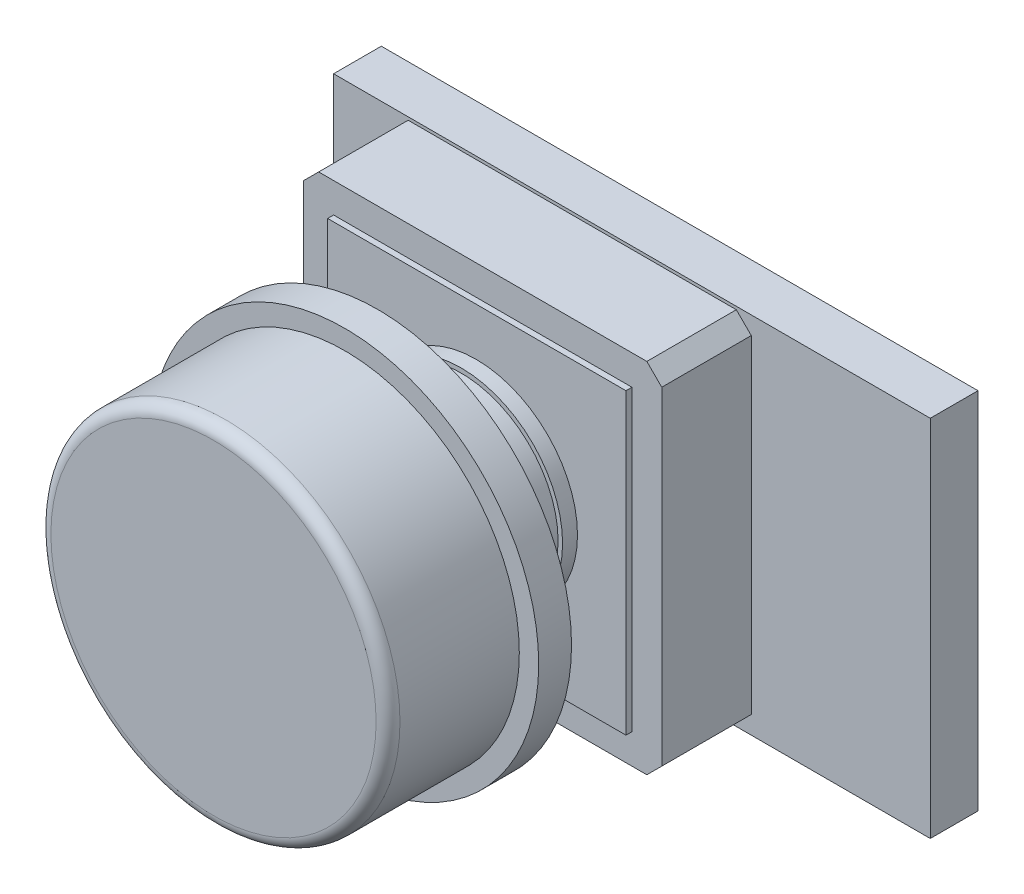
ISO-10303-21;
HEADER;
FILE_DESCRIPTION(('STEP AP214'),'2;1');
FILE_NAME('part.step','',(''),(''),'','','');
FILE_SCHEMA(('AUTOMOTIVE_DESIGN { 1 0 10303 214 1 1 1 1 }'));
ENDSEC;
DATA;
#1=APPLICATION_CONTEXT('core data for automotive mechanical design processes');
#2=APPLICATION_PROTOCOL_DEFINITION('international standard','automotive_design',2000,#1);
#3=PRODUCT_CONTEXT('',#1,'mechanical');
#4=PRODUCT('Part','Part','',(#3));
#5=PRODUCT_RELATED_PRODUCT_CATEGORY('part','',(#4));
#6=PRODUCT_DEFINITION_FORMATION('','',#4);
#7=PRODUCT_DEFINITION_CONTEXT('part definition',#1,'design');
#8=PRODUCT_DEFINITION('design','',#6,#7);
#9=PRODUCT_DEFINITION_SHAPE('','',#8);
#10=(LENGTH_UNIT() NAMED_UNIT(*) SI_UNIT(.MILLI.,.METRE.));
#11=(NAMED_UNIT(*) PLANE_ANGLE_UNIT() SI_UNIT($,.RADIAN.));
#12=(NAMED_UNIT(*) SI_UNIT($,.STERADIAN.) SOLID_ANGLE_UNIT());
#13=UNCERTAINTY_MEASURE_WITH_UNIT(LENGTH_MEASURE(1.E-05),#10,'distance_accuracy_value','');
#14=(GEOMETRIC_REPRESENTATION_CONTEXT(3) GLOBAL_UNCERTAINTY_ASSIGNED_CONTEXT((#13)) GLOBAL_UNIT_ASSIGNED_CONTEXT((#10,
#11,#12)) REPRESENTATION_CONTEXT('',''));
#15=CARTESIAN_POINT('',(0.,0.,0.));
#16=DIRECTION('',(0.,0.,1.));
#17=DIRECTION('',(1.,0.,0.));
#18=AXIS2_PLACEMENT_3D('',#15,#16,#17);
#19=CARTESIAN_POINT('',(0.,0.,-1.6));
#20=DIRECTION('',(0.,0.,1.));
#21=DIRECTION('',(1.,0.,0.));
#22=AXIS2_PLACEMENT_3D('',#19,#20,#21);
#23=PLANE('',#22);
#24=DIRECTION('',(1.,0.,0.));
#25=VECTOR('',#24,1.);
#26=CARTESIAN_POINT('',(-0.204354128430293,5.38055450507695,-1.6));
#27=LINE('',#26,#25);
#28=CARTESIAN_POINT('',(-0.204354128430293,5.38055450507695,-1.6));
#29=VERTEX_POINT('',#28);
#30=CARTESIAN_POINT('',(-0.0505079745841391,5.38055450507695,-1.6));
#31=VERTEX_POINT('',#30);
#32=EDGE_CURVE('E334',#29,#31,#27,.T.);
#33=ORIENTED_EDGE('',*,*,#32,.T.);
#34=DIRECTION('',(-0.496686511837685,0.867930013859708,0.));
#35=VECTOR('',#34,1.);
#36=CARTESIAN_POINT('',(-0.0505079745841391,5.38055450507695,-1.6));
#37=LINE('',#36,#35);
#38=CARTESIAN_POINT('',(-0.109201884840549,5.48311860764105,-1.6));
#39=VERTEX_POINT('',#38);
#40=EDGE_CURVE('E348',#31,#39,#37,.T.);
#41=ORIENTED_EDGE('',*,*,#40,.T.);
#42=DIRECTION('',(-1.,0.,0.));
#43=VECTOR('',#42,1.);
#44=CARTESIAN_POINT('',(-0.109201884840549,5.48311860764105,-1.6));
#45=LINE('',#44,#43);
#46=CARTESIAN_POINT('',(-0.294097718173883,5.48311860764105,-1.6));
#47=VERTEX_POINT('',#46);
#48=EDGE_CURVE('E313',#39,#47,#45,.T.);
#49=ORIENTED_EDGE('',*,*,#48,.T.);
#50=DIRECTION('',(0.,-1.,0.));
#51=VECTOR('',#50,1.);
#52=CARTESIAN_POINT('',(-0.294097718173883,5.48311860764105,-1.6));
#53=LINE('',#52,#51);
#54=CARTESIAN_POINT('',(-0.294097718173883,4.48311860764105,-1.6));
#55=VERTEX_POINT('',#54);
#56=EDGE_CURVE('E54',#47,#55,#53,.T.);
#57=ORIENTED_EDGE('',*,*,#56,.T.);
#58=DIRECTION('',(1.,0.,0.));
#59=VECTOR('',#58,1.);
#60=CARTESIAN_POINT('',(-0.294097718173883,4.48311860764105,-1.6));
#61=LINE('',#60,#59);
#62=CARTESIAN_POINT('',(-0.204354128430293,4.48311860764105,-1.6));
#63=VERTEX_POINT('',#62);
#64=EDGE_CURVE('E352',#55,#63,#61,.T.);
#65=ORIENTED_EDGE('',*,*,#64,.T.);
#66=DIRECTION('',(0.,1.,0.));
#67=VECTOR('',#66,1.);
#68=CARTESIAN_POINT('',(-0.204354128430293,4.48311860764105,-1.6));
#69=LINE('',#68,#67);
#70=EDGE_CURVE('E337',#63,#29,#69,.T.);
#71=ORIENTED_EDGE('',*,*,#70,.T.);
#72=EDGE_LOOP('',(#33,#41,#49,#57,#65,#71));
#73=FACE_BOUND('',#72,.T.);
#74=DIRECTION('',(1.,0.,0.));
#75=VECTOR('',#74,1.);
#76=CARTESIAN_POINT('',(0.770004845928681,4.48311860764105,-1.6));
#77=LINE('',#76,#75);
#78=CARTESIAN_POINT('',(0.770004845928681,4.48311860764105,-1.6));
#79=VERTEX_POINT('',#78);
#80=CARTESIAN_POINT('',(0.859748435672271,4.48311860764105,-1.6));
#81=VERTEX_POINT('',#80);
#82=EDGE_CURVE('E523',#79,#81,#77,.T.);
#83=ORIENTED_EDGE('',*,*,#82,.T.);
#84=DIRECTION('',(0.,1.,0.));
#85=VECTOR('',#84,1.);
#86=CARTESIAN_POINT('',(0.859748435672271,4.48311860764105,-1.6));
#87=LINE('',#86,#85);
#88=CARTESIAN_POINT('',(0.859748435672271,5.48311860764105,-1.6));
#89=VERTEX_POINT('',#88);
#90=EDGE_CURVE('E479',#81,#89,#87,.T.);
#91=ORIENTED_EDGE('',*,*,#90,.T.);
#92=DIRECTION('',(-1.,0.,0.));
#93=VECTOR('',#92,1.);
#94=CARTESIAN_POINT('',(0.859748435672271,5.48311860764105,-1.6));
#95=LINE('',#94,#93);
#96=CARTESIAN_POINT('',(0.659628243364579,5.48311860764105,-1.6));
#97=VERTEX_POINT('',#96);
#98=EDGE_CURVE('E482',#89,#97,#95,.T.);
#99=ORIENTED_EDGE('',*,*,#98,.T.);
#100=CARTESIAN_POINT('',(0.659628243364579,5.48311860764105,-1.6));
#101=CARTESIAN_POINT('',(0.646273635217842,5.48307415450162,-1.6));
#102=CARTESIAN_POINT('',(0.620631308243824,5.48298879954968,-1.6));
#103=CARTESIAN_POINT('',(0.58389608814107,5.48251286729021,-1.6));
#104=CARTESIAN_POINT('',(0.550516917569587,5.48114876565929,-1.6));
#105=CARTESIAN_POINT('',(0.520511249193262,5.47997488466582,-1.6));
#106=CARTESIAN_POINT('',(0.493879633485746,5.47783433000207,-1.6));
#107=CARTESIAN_POINT('',(0.47054040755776,5.47578843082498,-1.6));
#108=CARTESIAN_POINT('',(0.450601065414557,5.47311024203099,-1.6));
#109=CARTESIAN_POINT('',(0.438530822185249,5.47062297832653,-1.6));
#110=CARTESIAN_POINT('',(0.433065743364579,5.46949681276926,-1.6));
#111=B_SPLINE_CURVE_WITH_KNOTS('',3,(#100,#101,#102,#103,#104,#105,#106,#107,#108,#109,#110),
.UNSPECIFIED.,.F.,.F.,(4,1,1,1,1,1,1,1,4),(0.,0.1762577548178,0.338434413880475,
0.484822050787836,0.617157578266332,0.734698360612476,0.83738518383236,0.926372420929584,1.),.UNSPECIFIED.);
#112=CARTESIAN_POINT('',(0.433065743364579,5.46949681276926,-1.6));
#113=VERTEX_POINT('',#112);
#114=EDGE_CURVE('E62',#97,#113,#111,.T.);
#115=ORIENTED_EDGE('',*,*,#114,.T.);
#116=CARTESIAN_POINT('',(0.433065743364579,5.46949681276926,-1.6));
#117=CARTESIAN_POINT('',(0.425749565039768,5.46768916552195,-1.6));
#118=CARTESIAN_POINT('',(0.411273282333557,5.46411243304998,-1.6));
#119=CARTESIAN_POINT('',(0.39043040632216,5.45655254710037,-1.6));
#120=CARTESIAN_POINT('',(0.370569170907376,5.44780408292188,-1.6));
#121=CARTESIAN_POINT('',(0.35177207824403,5.43752873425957,-1.6));
#122=CARTESIAN_POINT('',(0.334133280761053,5.42565022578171,-1.6));
#123=CARTESIAN_POINT('',(0.317470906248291,5.41237361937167,-1.6));
#124=CARTESIAN_POINT('',(0.301709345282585,5.3977715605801,-1.6));
#125=CARTESIAN_POINT('',(0.287486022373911,5.38147589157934,-1.6));
#126=CARTESIAN_POINT('',(0.274074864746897,5.36437974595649,-1.6));
#127=CARTESIAN_POINT('',(0.262763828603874,5.34589295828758,-1.6));
#128=CARTESIAN_POINT('',(0.25301340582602,5.32656109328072,-1.6));
#129=CARTESIAN_POINT('',(0.245250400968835,5.30618754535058,-1.6));
#130=CARTESIAN_POINT('',(0.238999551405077,5.28496989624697,-1.6));
#131=CARTESIAN_POINT('',(0.234592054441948,5.26271595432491,-1.6));
#132=CARTESIAN_POINT('',(0.231948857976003,5.23952710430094,-1.6));
#133=CARTESIAN_POINT('',(0.231679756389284,5.22371055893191,-1.6));
#134=CARTESIAN_POINT('',(0.231543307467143,5.21569072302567,-1.6));
#135=B_SPLINE_CURVE_WITH_KNOTS('',3,(#116,#117,#118,#119,#120,#121,#122,#123,#124,#125,#126,
#127,#128,#129,#130,#131,#132,#133,#134),.UNSPECIFIED.,.F.,.F.,(4,1,1,1,1,1,1,1,1,1,1,1,1,1,1,1,
4),(0.,0.0642168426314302,0.127063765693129,0.188744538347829,0.249132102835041,
0.309452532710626,0.369826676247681,0.430650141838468,0.492351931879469,0.554072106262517,
0.615689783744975,0.676797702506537,0.738439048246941,0.801316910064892,0.865184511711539,
0.931641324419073,1.),.UNSPECIFIED.);
#136=CARTESIAN_POINT('',(0.231543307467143,5.21569072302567,-1.6));
#137=VERTEX_POINT('',#136);
#138=EDGE_CURVE('E489',#113,#137,#135,.T.);
#139=ORIENTED_EDGE('',*,*,#138,.T.);
#140=CARTESIAN_POINT('',(0.231543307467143,5.21569072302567,-1.6));
#141=CARTESIAN_POINT('',(0.231963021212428,5.20236640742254,-1.6));
#142=CARTESIAN_POINT('',(0.232781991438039,5.17636721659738,-1.6));
#143=CARTESIAN_POINT('',(0.240417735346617,5.13863553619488,-1.6));
#144=CARTESIAN_POINT('',(0.252925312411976,5.10343858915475,-1.6));
#145=CARTESIAN_POINT('',(0.270160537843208,5.07082069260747,-1.6));
#146=CARTESIAN_POINT('',(0.292108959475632,5.04141765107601,-1.6));
#147=CARTESIAN_POINT('',(0.318487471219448,5.01559180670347,-1.6));
#148=CARTESIAN_POINT('',(0.349310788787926,4.99398040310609,-1.6));
#149=CARTESIAN_POINT('',(0.378004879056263,4.97899388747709,-1.6));
#150=CARTESIAN_POINT('',(0.403351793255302,4.96939591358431,-1.6));
#151=CARTESIAN_POINT('',(0.42421845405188,4.96264266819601,-1.6));
#152=CARTESIAN_POINT('',(0.446980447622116,4.95742496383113,-1.6));
#153=CARTESIAN_POINT('',(0.471419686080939,4.9527506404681,-1.6));
#154=CARTESIAN_POINT('',(0.497637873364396,4.94922158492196,-1.6));
#155=CARTESIAN_POINT('',(0.525572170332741,4.946636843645,-1.6));
#156=CARTESIAN_POINT('',(0.555242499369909,4.94502140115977,-1.6));
#157=CARTESIAN_POINT('',(0.575625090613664,4.94478082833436,-1.6));
#158=CARTESIAN_POINT('',(0.586110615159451,4.94465706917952,-1.6));
#159=B_SPLINE_CURVE_WITH_KNOTS('',3,(#140,#141,#142,#143,#144,#145,#146,#147,#148,#149,#150,
#151,#152,#153,#154,#155,#156,#157,#158),.UNSPECIFIED.,.F.,.F.,(4,1,1,1,1,1,1,1,1,1,1,1,1,1,1,1,
4),(0.,0.0787802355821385,0.153720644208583,0.226713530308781,0.299191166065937,
0.371189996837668,0.443006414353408,0.51668917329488,0.593217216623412,0.633872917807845,
0.676989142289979,0.722899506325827,0.771958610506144,0.824211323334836,0.879378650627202,
0.937948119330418,1.),.UNSPECIFIED.);
#160=CARTESIAN_POINT('',(0.586110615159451,4.94465706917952,-1.6));
#161=VERTEX_POINT('',#160);
#162=EDGE_CURVE('E497',#137,#161,#159,.T.);
#163=ORIENTED_EDGE('',*,*,#162,.T.);
#164=DIRECTION('',(-0.622788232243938,-0.782390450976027,0.));
#165=VECTOR('',#164,1.);
#166=CARTESIAN_POINT('',(0.586110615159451,4.94465706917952,-1.6));
#167=LINE('',#166,#165);
#168=CARTESIAN_POINT('',(0.21872279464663,4.48311860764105,-1.6));
#169=VERTEX_POINT('',#168);
#170=EDGE_CURVE('E505',#161,#169,#167,.T.);
#171=ORIENTED_EDGE('',*,*,#170,.T.);
#172=DIRECTION('',(1.,0.,0.));
#173=VECTOR('',#172,1.);
#174=CARTESIAN_POINT('',(0.21872279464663,4.48311860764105,-1.6));
#175=LINE('',#174,#173);
#176=CARTESIAN_POINT('',(0.329700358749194,4.48311860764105,-1.6));
#177=VERTEX_POINT('',#176);
#178=EDGE_CURVE('E511',#169,#177,#175,.T.);
#179=ORIENTED_EDGE('',*,*,#178,.T.);
#180=DIRECTION('',(0.622788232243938,0.782390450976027,0.));
#181=VECTOR('',#180,1.);
#182=CARTESIAN_POINT('',(0.329700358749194,4.48311860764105,-1.6));
#183=LINE('',#182,#181);
#184=CARTESIAN_POINT('',(0.697088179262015,4.94465706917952,-1.6));
#185=VERTEX_POINT('',#184);
#186=EDGE_CURVE('E514',#177,#185,#183,.T.);
#187=ORIENTED_EDGE('',*,*,#186,.T.);
#188=DIRECTION('',(1.,0.,0.));
#189=VECTOR('',#188,1.);
#190=CARTESIAN_POINT('',(0.697088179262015,4.94465706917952,-1.6));
#191=LINE('',#190,#189);
#192=CARTESIAN_POINT('',(0.770004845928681,4.94465706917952,-1.6));
#193=VERTEX_POINT('',#192);
#194=EDGE_CURVE('E517',#185,#193,#191,.T.);
#195=ORIENTED_EDGE('',*,*,#194,.T.);
#196=DIRECTION('',(0.,-1.,0.));
#197=VECTOR('',#196,1.);
#198=CARTESIAN_POINT('',(0.770004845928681,4.94465706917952,-1.6));
#199=LINE('',#198,#197);
#200=EDGE_CURVE('E520',#193,#79,#199,.T.);
#201=ORIENTED_EDGE('',*,*,#200,.T.);
#202=EDGE_LOOP('',(#83,#91,#99,#115,#139,#163,#171,#179,#187,#195,#201));
#203=FACE_BOUND('',#202,.T.);
#204=DIRECTION('',(0.,-1.,0.));
#205=VECTOR('',#204,1.);
#206=CARTESIAN_POINT('',(3.65429815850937,5.50260330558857,-1.6));
#207=LINE('',#206,#205);
#208=CARTESIAN_POINT('',(3.65429815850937,5.50260330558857,-1.6));
#209=VERTEX_POINT('',#208);
#210=CARTESIAN_POINT('',(3.65429815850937,4.32627480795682,-1.6));
#211=VERTEX_POINT('',#210);
#212=EDGE_CURVE('E529',#209,#211,#207,.T.);
#213=ORIENTED_EDGE('',*,*,#212,.F.);
#214=DIRECTION('',(1.,0.,0.));
#215=VECTOR('',#214,1.);
#216=CARTESIAN_POINT('',(3.65429815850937,5.50260330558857,-1.6));
#217=LINE('',#216,#215);
#218=CARTESIAN_POINT('',(1.69375066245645,5.50260330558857,-1.6));
#219=VERTEX_POINT('',#218);
#220=EDGE_CURVE('E553',#219,#209,#217,.T.);
#221=ORIENTED_EDGE('',*,*,#220,.F.);
#222=DIRECTION('',(0.,1.,0.));
#223=VECTOR('',#222,1.);
#224=CARTESIAN_POINT('',(1.69375066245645,5.50260330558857,-1.6));
#225=LINE('',#224,#223);
#226=CARTESIAN_POINT('',(1.69375066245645,4.32627480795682,-1.6));
#227=VERTEX_POINT('',#226);
#228=EDGE_CURVE('E565',#227,#219,#225,.T.);
#229=ORIENTED_EDGE('',*,*,#228,.F.);
#230=DIRECTION('',(-1.,0.,0.));
#231=VECTOR('',#230,1.);
#232=CARTESIAN_POINT('',(3.65429815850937,4.32627480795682,-1.6));
#233=LINE('',#232,#231);
#234=EDGE_CURVE('E562',#211,#227,#233,.T.);
#235=ORIENTED_EDGE('',*,*,#234,.F.);
#236=EDGE_LOOP('',(#213,#221,#229,#235));
#237=FACE_BOUND('',#236,.T.);
#238=DIRECTION('',(0.,-1.,0.));
#239=VECTOR('',#238,1.);
#240=CARTESIAN_POINT('',(-13.,6.1,-1.6));
#241=LINE('',#240,#239);
#242=CARTESIAN_POINT('',(-13.,6.1,-1.6));
#243=VERTEX_POINT('',#242);
#244=CARTESIAN_POINT('',(-13.,-6.1,-1.6));
#245=VERTEX_POINT('',#244);
#246=EDGE_CURVE('E693',#243,#245,#241,.T.);
#247=ORIENTED_EDGE('',*,*,#246,.F.);
#248=DIRECTION('',(-1.,0.,0.));
#249=VECTOR('',#248,1.);
#250=CARTESIAN_POINT('',(-13.,6.1,-1.6));
#251=LINE('',#250,#249);
#252=CARTESIAN_POINT('',(7.,6.1,-1.6));
#253=VERTEX_POINT('',#252);
#254=EDGE_CURVE('E703',#253,#243,#251,.T.);
#255=ORIENTED_EDGE('',*,*,#254,.F.);
#256=DIRECTION('',(0.,1.,0.));
#257=VECTOR('',#256,1.);
#258=CARTESIAN_POINT('',(7.,6.1,-1.6));
#259=LINE('',#258,#257);
#260=CARTESIAN_POINT('',(7.,-6.1,-1.6));
#261=VERTEX_POINT('',#260);
#262=EDGE_CURVE('E700',#261,#253,#259,.T.);
#263=ORIENTED_EDGE('',*,*,#262,.F.);
#264=DIRECTION('',(1.,0.,0.));
#265=VECTOR('',#264,1.);
#266=CARTESIAN_POINT('',(-13.,-6.1,-1.6));
#267=LINE('',#266,#265);
#268=EDGE_CURVE('E696',#245,#261,#267,.T.);
#269=ORIENTED_EDGE('',*,*,#268,.F.);
#270=EDGE_LOOP('',(#247,#255,#263,#269));
#271=FACE_BOUND('',#270,.T.);
#272=ADVANCED_FACE('F39',(#73,#203,#237,#271),#23,.F.);
#273=CARTESIAN_POINT('',(0.,0.,3.));
#274=DIRECTION('',(0.,0.,-1.));
#275=DIRECTION('',(-1.,0.,0.));
#276=AXIS2_PLACEMENT_3D('',#273,#274,#275);
#277=PLANE('',#276);
#278=DIRECTION('',(-0.707106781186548,-0.707106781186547,0.));
#279=VECTOR('',#278,1.);
#280=CARTESIAN_POINT('',(-11.,5.5,3.));
#281=LINE('',#280,#279);
#282=CARTESIAN_POINT('',(-10.5,6.,3.));
#283=VERTEX_POINT('',#282);
#284=CARTESIAN_POINT('',(-11.,5.5,3.));
#285=VERTEX_POINT('',#284);
#286=EDGE_CURVE('E636',#283,#285,#281,.T.);
#287=ORIENTED_EDGE('',*,*,#286,.T.);
#288=DIRECTION('',(0.,-1.,0.));
#289=VECTOR('',#288,1.);
#290=CARTESIAN_POINT('',(-11.,5.5,3.));
#291=LINE('',#290,#289);
#292=CARTESIAN_POINT('',(-11.,-5.5,3.));
#293=VERTEX_POINT('',#292);
#294=EDGE_CURVE('E639',#285,#293,#291,.T.);
#295=ORIENTED_EDGE('',*,*,#294,.T.);
#296=DIRECTION('',(0.707106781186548,-0.707106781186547,0.));
#297=VECTOR('',#296,1.);
#298=CARTESIAN_POINT('',(-11.,-5.5,3.));
#299=LINE('',#298,#297);
#300=CARTESIAN_POINT('',(-10.5,-6.,3.));
#301=VERTEX_POINT('',#300);
#302=EDGE_CURVE('E642',#293,#301,#299,.T.);
#303=ORIENTED_EDGE('',*,*,#302,.T.);
#304=DIRECTION('',(1.,0.,0.));
#305=VECTOR('',#304,1.);
#306=CARTESIAN_POINT('',(-10.5,-6.,3.));
#307=LINE('',#306,#305);
#308=CARTESIAN_POINT('',(0.500000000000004,-6.,3.));
#309=VERTEX_POINT('',#308);
#310=EDGE_CURVE('E644',#301,#309,#307,.T.);
#311=ORIENTED_EDGE('',*,*,#310,.T.);
#312=DIRECTION('',(0.707106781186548,0.707106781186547,0.));
#313=VECTOR('',#312,1.);
#314=CARTESIAN_POINT('',(0.500000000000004,-6.,3.));
#315=LINE('',#314,#313);
#316=CARTESIAN_POINT('',(1.,-5.5,3.));
#317=VERTEX_POINT('',#316);
#318=EDGE_CURVE('E646',#309,#317,#315,.T.);
#319=ORIENTED_EDGE('',*,*,#318,.T.);
#320=DIRECTION('',(0.,1.,0.));
#321=VECTOR('',#320,1.);
#322=CARTESIAN_POINT('',(1.,5.5,3.));
#323=LINE('',#322,#321);
#324=CARTESIAN_POINT('',(1.,5.5,3.));
#325=VERTEX_POINT('',#324);
#326=EDGE_CURVE('E648',#317,#325,#323,.T.);
#327=ORIENTED_EDGE('',*,*,#326,.T.);
#328=DIRECTION('',(-0.707106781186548,0.707106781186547,0.));
#329=VECTOR('',#328,1.);
#330=CARTESIAN_POINT('',(0.500000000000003,6.,3.));
#331=LINE('',#330,#329);
#332=CARTESIAN_POINT('',(0.500000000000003,6.,3.));
#333=VERTEX_POINT('',#332);
#334=EDGE_CURVE('E650',#325,#333,#331,.T.);
#335=ORIENTED_EDGE('',*,*,#334,.T.);
#336=DIRECTION('',(-1.,0.,0.));
#337=VECTOR('',#336,1.);
#338=CARTESIAN_POINT('',(-10.5,6.,3.));
#339=LINE('',#338,#337);
#340=EDGE_CURVE('E652',#333,#283,#339,.T.);
#341=ORIENTED_EDGE('',*,*,#340,.T.);
#342=EDGE_LOOP('',(#287,#295,#303,#311,#319,#327,#335,#341));
#343=FACE_BOUND('',#342,.T.);
#344=DIRECTION('',(0.,-1.,0.));
#345=VECTOR('',#344,1.);
#346=CARTESIAN_POINT('',(-9.99999999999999,-5.,3.));
#347=LINE('',#346,#345);
#348=CARTESIAN_POINT('',(-9.99999999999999,5.,3.));
#349=VERTEX_POINT('',#348);
#350=CARTESIAN_POINT('',(-9.99999999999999,-5.,3.));
#351=VERTEX_POINT('',#350);
#352=EDGE_CURVE('E602',#349,#351,#347,.T.);
#353=ORIENTED_EDGE('',*,*,#352,.F.);
#354=DIRECTION('',(-1.,0.,0.));
#355=VECTOR('',#354,1.);
#356=CARTESIAN_POINT('',(-9.99999999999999,5.,3.));
#357=LINE('',#356,#355);
#358=CARTESIAN_POINT('',(0.,5.,3.));
#359=VERTEX_POINT('',#358);
#360=EDGE_CURVE('E607',#359,#349,#357,.T.);
#361=ORIENTED_EDGE('',*,*,#360,.F.);
#362=DIRECTION('',(0.,1.,0.));
#363=VECTOR('',#362,1.);
#364=CARTESIAN_POINT('',(0.,5.,3.));
#365=LINE('',#364,#363);
#366=CARTESIAN_POINT('',(0.,-5.,3.));
#367=VERTEX_POINT('',#366);
#368=EDGE_CURVE('E619',#367,#359,#365,.T.);
#369=ORIENTED_EDGE('',*,*,#368,.F.);
#370=DIRECTION('',(1.,0.,0.));
#371=VECTOR('',#370,1.);
#372=CARTESIAN_POINT('',(0.,-5.,3.));
#373=LINE('',#372,#371);
#374=EDGE_CURVE('E616',#351,#367,#373,.T.);
#375=ORIENTED_EDGE('',*,*,#374,.F.);
#376=EDGE_LOOP('',(#353,#361,#369,#375));
#377=FACE_BOUND('',#376,.T.);
#378=ADVANCED_FACE('F748',(#343,#377),#277,.F.);
#379=CARTESIAN_POINT('',(0.,0.,0.));
#380=DIRECTION('',(0.,0.,1.));
#381=DIRECTION('',(1.,0.,0.));
#382=AXIS2_PLACEMENT_3D('',#379,#380,#381);
#383=PLANE('',#382);
#384=DIRECTION('',(0.,-1.,0.));
#385=VECTOR('',#384,1.);
#386=CARTESIAN_POINT('',(-13.,6.1,0.));
#387=LINE('',#386,#385);
#388=CARTESIAN_POINT('',(-13.,6.1,0.));
#389=VERTEX_POINT('',#388);
#390=CARTESIAN_POINT('',(-13.,-6.1,0.));
#391=VERTEX_POINT('',#390);
#392=EDGE_CURVE('E692',#389,#391,#387,.T.);
#393=ORIENTED_EDGE('',*,*,#392,.T.);
#394=DIRECTION('',(1.,0.,0.));
#395=VECTOR('',#394,1.);
#396=CARTESIAN_POINT('',(-13.,-6.1,0.));
#397=LINE('',#396,#395);
#398=CARTESIAN_POINT('',(7.,-6.1,0.));
#399=VERTEX_POINT('',#398);
#400=EDGE_CURVE('E709',#391,#399,#397,.T.);
#401=ORIENTED_EDGE('',*,*,#400,.T.);
#402=DIRECTION('',(0.,1.,0.));
#403=VECTOR('',#402,1.);
#404=CARTESIAN_POINT('',(7.,6.1,0.));
#405=LINE('',#404,#403);
#406=CARTESIAN_POINT('',(7.,6.1,0.));
#407=VERTEX_POINT('',#406);
#408=EDGE_CURVE('E712',#399,#407,#405,.T.);
#409=ORIENTED_EDGE('',*,*,#408,.T.);
#410=DIRECTION('',(-1.,0.,0.));
#411=VECTOR('',#410,1.);
#412=CARTESIAN_POINT('',(-13.,6.1,0.));
#413=LINE('',#412,#411);
#414=EDGE_CURVE('E697',#407,#389,#413,.T.);
#415=ORIENTED_EDGE('',*,*,#414,.T.);
#416=EDGE_LOOP('',(#393,#401,#409,#415));
#417=FACE_BOUND('',#416,.T.);
#418=DIRECTION('',(0.,-1.,0.));
#419=VECTOR('',#418,1.);
#420=CARTESIAN_POINT('',(-11.,5.5,0.));
#421=LINE('',#420,#419);
#422=CARTESIAN_POINT('',(-11.,5.5,0.));
#423=VERTEX_POINT('',#422);
#424=CARTESIAN_POINT('',(-11.,-5.5,0.));
#425=VERTEX_POINT('',#424);
#426=EDGE_CURVE('E657',#423,#425,#421,.T.);
#427=ORIENTED_EDGE('',*,*,#426,.F.);
#428=DIRECTION('',(-0.707106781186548,-0.707106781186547,0.));
#429=VECTOR('',#428,1.);
#430=CARTESIAN_POINT('',(-11.,5.5,0.));
#431=LINE('',#430,#429);
#432=CARTESIAN_POINT('',(-10.5,6.,0.));
#433=VERTEX_POINT('',#432);
#434=EDGE_CURVE('E635',#433,#423,#431,.T.);
#435=ORIENTED_EDGE('',*,*,#434,.F.);
#436=DIRECTION('',(-1.,0.,0.));
#437=VECTOR('',#436,1.);
#438=CARTESIAN_POINT('',(-10.5,6.,0.));
#439=LINE('',#438,#437);
#440=CARTESIAN_POINT('',(0.500000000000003,6.,0.));
#441=VERTEX_POINT('',#440);
#442=EDGE_CURVE('E640',#441,#433,#439,.T.);
#443=ORIENTED_EDGE('',*,*,#442,.F.);
#444=DIRECTION('',(-0.707106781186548,0.707106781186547,0.));
#445=VECTOR('',#444,1.);
#446=CARTESIAN_POINT('',(0.500000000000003,6.,0.));
#447=LINE('',#446,#445);
#448=CARTESIAN_POINT('',(1.,5.5,0.));
#449=VERTEX_POINT('',#448);
#450=EDGE_CURVE('E667',#449,#441,#447,.T.);
#451=ORIENTED_EDGE('',*,*,#450,.F.);
#452=DIRECTION('',(0.,1.,0.));
#453=VECTOR('',#452,1.);
#454=CARTESIAN_POINT('',(1.,5.5,0.));
#455=LINE('',#454,#453);
#456=CARTESIAN_POINT('',(1.,-5.5,0.));
#457=VERTEX_POINT('',#456);
#458=EDGE_CURVE('E665',#457,#449,#455,.T.);
#459=ORIENTED_EDGE('',*,*,#458,.F.);
#460=DIRECTION('',(0.707106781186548,0.707106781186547,0.));
#461=VECTOR('',#460,1.);
#462=CARTESIAN_POINT('',(0.500000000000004,-6.,0.));
#463=LINE('',#462,#461);
#464=CARTESIAN_POINT('',(0.500000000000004,-6.,0.));
#465=VERTEX_POINT('',#464);
#466=EDGE_CURVE('E663',#465,#457,#463,.T.);
#467=ORIENTED_EDGE('',*,*,#466,.F.);
#468=DIRECTION('',(1.,0.,0.));
#469=VECTOR('',#468,1.);
#470=CARTESIAN_POINT('',(-10.5,-6.,0.));
#471=LINE('',#470,#469);
#472=CARTESIAN_POINT('',(-10.5,-6.,0.));
#473=VERTEX_POINT('',#472);
#474=EDGE_CURVE('E661',#473,#465,#471,.T.);
#475=ORIENTED_EDGE('',*,*,#474,.F.);
#476=DIRECTION('',(0.707106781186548,-0.707106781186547,0.));
#477=VECTOR('',#476,1.);
#478=CARTESIAN_POINT('',(-11.,-5.5,0.));
#479=LINE('',#478,#477);
#480=EDGE_CURVE('E659',#425,#473,#479,.T.);
#481=ORIENTED_EDGE('',*,*,#480,.F.);
#482=EDGE_LOOP('',(#427,#435,#443,#451,#459,#467,#475,#481));
#483=FACE_BOUND('',#482,.T.);
#484=ADVANCED_FACE('F750',(#417,#483),#383,.T.);
#485=CARTESIAN_POINT('',(-13.,6.1,-1.6));
#486=DIRECTION('',(-1.,0.,0.));
#487=DIRECTION('',(0.,0.,1.));
#488=AXIS2_PLACEMENT_3D('',#485,#486,#487);
#489=PLANE('',#488);
#490=ORIENTED_EDGE('',*,*,#392,.F.);
#491=DIRECTION('',(0.,0.,1.));
#492=VECTOR('',#491,1.);
#493=CARTESIAN_POINT('',(-13.,6.1,-1.6));
#494=LINE('',#493,#492);
#495=EDGE_CURVE('E717',#243,#389,#494,.T.);
#496=ORIENTED_EDGE('',*,*,#495,.F.);
#497=ORIENTED_EDGE('',*,*,#246,.T.);
#498=DIRECTION('',(0.,0.,1.));
#499=VECTOR('',#498,1.);
#500=CARTESIAN_POINT('',(-13.,-6.1,-1.6));
#501=LINE('',#500,#499);
#502=EDGE_CURVE('E706',#245,#391,#501,.T.);
#503=ORIENTED_EDGE('',*,*,#502,.T.);
#504=EDGE_LOOP('',(#490,#496,#497,#503));
#505=FACE_BOUND('',#504,.T.);
#506=ADVANCED_FACE('F41',(#505),#489,.T.);
#507=CARTESIAN_POINT('',(-13.,6.1,-1.6));
#508=DIRECTION('',(0.,1.,0.));
#509=DIRECTION('',(0.,0.,1.));
#510=AXIS2_PLACEMENT_3D('',#507,#508,#509);
#511=PLANE('',#510);
#512=ORIENTED_EDGE('',*,*,#414,.F.);
#513=DIRECTION('',(0.,0.,1.));
#514=VECTOR('',#513,1.);
#515=CARTESIAN_POINT('',(7.,6.1,-1.6));
#516=LINE('',#515,#514);
#517=EDGE_CURVE('E719',#253,#407,#516,.T.);
#518=ORIENTED_EDGE('',*,*,#517,.F.);
#519=ORIENTED_EDGE('',*,*,#254,.T.);
#520=ORIENTED_EDGE('',*,*,#495,.T.);
#521=EDGE_LOOP('',(#512,#518,#519,#520));
#522=FACE_BOUND('',#521,.T.);
#523=ADVANCED_FACE('F800',(#522),#511,.T.);
#524=CARTESIAN_POINT('',(7.,6.1,-1.6));
#525=DIRECTION('',(1.,0.,0.));
#526=DIRECTION('',(0.,0.,-1.));
#527=AXIS2_PLACEMENT_3D('',#524,#525,#526);
#528=PLANE('',#527);
#529=ORIENTED_EDGE('',*,*,#408,.F.);
#530=DIRECTION('',(0.,0.,1.));
#531=VECTOR('',#530,1.);
#532=CARTESIAN_POINT('',(7.,-6.1,-1.6));
#533=LINE('',#532,#531);
#534=EDGE_CURVE('E721',#261,#399,#533,.T.);
#535=ORIENTED_EDGE('',*,*,#534,.F.);
#536=ORIENTED_EDGE('',*,*,#262,.T.);
#537=ORIENTED_EDGE('',*,*,#517,.T.);
#538=EDGE_LOOP('',(#529,#535,#536,#537));
#539=FACE_BOUND('',#538,.T.);
#540=ADVANCED_FACE('F803',(#539),#528,.T.);
#541=CARTESIAN_POINT('',(-13.,-6.1,-1.6));
#542=DIRECTION('',(0.,-1.,0.));
#543=DIRECTION('',(0.,0.,-1.));
#544=AXIS2_PLACEMENT_3D('',#541,#542,#543);
#545=PLANE('',#544);
#546=ORIENTED_EDGE('',*,*,#400,.F.);
#547=ORIENTED_EDGE('',*,*,#502,.F.);
#548=ORIENTED_EDGE('',*,*,#268,.T.);
#549=ORIENTED_EDGE('',*,*,#534,.T.);
#550=EDGE_LOOP('',(#546,#547,#548,#549));
#551=FACE_BOUND('',#550,.T.);
#552=ADVANCED_FACE('F795',(#551),#545,.T.);
#553=CARTESIAN_POINT('',(-11.,5.5,3.));
#554=DIRECTION('',(0.707106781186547,-0.707106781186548,0.));
#555=DIRECTION('',(0.707106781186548,0.707106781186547,0.));
#556=AXIS2_PLACEMENT_3D('',#553,#554,#555);
#557=PLANE('',#556);
#558=ORIENTED_EDGE('',*,*,#434,.T.);
#559=DIRECTION('',(0.,0.,-1.));
#560=VECTOR('',#559,1.);
#561=CARTESIAN_POINT('',(-11.,5.5,3.));
#562=LINE('',#561,#560);
#563=EDGE_CURVE('E690',#285,#423,#562,.T.);
#564=ORIENTED_EDGE('',*,*,#563,.F.);
#565=ORIENTED_EDGE('',*,*,#286,.F.);
#566=DIRECTION('',(0.,0.,-1.));
#567=VECTOR('',#566,1.);
#568=CARTESIAN_POINT('',(-10.5,6.,3.));
#569=LINE('',#568,#567);
#570=EDGE_CURVE('E654',#283,#433,#569,.T.);
#571=ORIENTED_EDGE('',*,*,#570,.T.);
#572=EDGE_LOOP('',(#558,#564,#565,#571));
#573=FACE_BOUND('',#572,.T.);
#574=ADVANCED_FACE('F792',(#573),#557,.F.);
#575=CARTESIAN_POINT('',(-11.,5.5,3.));
#576=DIRECTION('',(1.,0.,0.));
#577=DIRECTION('',(0.,1.,0.));
#578=AXIS2_PLACEMENT_3D('',#575,#576,#577);
#579=PLANE('',#578);
#580=ORIENTED_EDGE('',*,*,#426,.T.);
#581=DIRECTION('',(0.,0.,-1.));
#582=VECTOR('',#581,1.);
#583=CARTESIAN_POINT('',(-11.,-5.5,3.));
#584=LINE('',#583,#582);
#585=EDGE_CURVE('E687',#293,#425,#584,.T.);
#586=ORIENTED_EDGE('',*,*,#585,.F.);
#587=ORIENTED_EDGE('',*,*,#294,.F.);
#588=ORIENTED_EDGE('',*,*,#563,.T.);
#589=EDGE_LOOP('',(#580,#586,#587,#588));
#590=FACE_BOUND('',#589,.T.);
#591=ADVANCED_FACE('F788',(#590),#579,.F.);
#592=CARTESIAN_POINT('',(-11.,-5.5,3.));
#593=DIRECTION('',(0.707106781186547,0.707106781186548,0.));
#594=DIRECTION('',(-0.707106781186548,0.707106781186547,0.));
#595=AXIS2_PLACEMENT_3D('',#592,#593,#594);
#596=PLANE('',#595);
#597=ORIENTED_EDGE('',*,*,#480,.T.);
#598=DIRECTION('',(0.,0.,-1.));
#599=VECTOR('',#598,1.);
#600=CARTESIAN_POINT('',(-10.5,-6.,3.));
#601=LINE('',#600,#599);
#602=EDGE_CURVE('E684',#301,#473,#601,.T.);
#603=ORIENTED_EDGE('',*,*,#602,.F.);
#604=ORIENTED_EDGE('',*,*,#302,.F.);
#605=ORIENTED_EDGE('',*,*,#585,.T.);
#606=EDGE_LOOP('',(#597,#603,#604,#605));
#607=FACE_BOUND('',#606,.T.);
#608=ADVANCED_FACE('F784',(#607),#596,.F.);
#609=CARTESIAN_POINT('',(-10.5,-6.,3.));
#610=DIRECTION('',(0.,1.,0.));
#611=DIRECTION('',(0.,0.,1.));
#612=AXIS2_PLACEMENT_3D('',#609,#610,#611);
#613=PLANE('',#612);
#614=ORIENTED_EDGE('',*,*,#474,.T.);
#615=DIRECTION('',(0.,0.,-1.));
#616=VECTOR('',#615,1.);
#617=CARTESIAN_POINT('',(0.500000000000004,-6.,3.));
#618=LINE('',#617,#616);
#619=EDGE_CURVE('E681',#309,#465,#618,.T.);
#620=ORIENTED_EDGE('',*,*,#619,.F.);
#621=ORIENTED_EDGE('',*,*,#310,.F.);
#622=ORIENTED_EDGE('',*,*,#602,.T.);
#623=EDGE_LOOP('',(#614,#620,#621,#622));
#624=FACE_BOUND('',#623,.T.);
#625=ADVANCED_FACE('F780',(#624),#613,.F.);
#626=CARTESIAN_POINT('',(0.500000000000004,-6.,3.));
#627=DIRECTION('',(-0.707106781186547,0.707106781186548,0.));
#628=DIRECTION('',(-0.707106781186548,-0.707106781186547,0.));
#629=AXIS2_PLACEMENT_3D('',#626,#627,#628);
#630=PLANE('',#629);
#631=ORIENTED_EDGE('',*,*,#466,.T.);
#632=DIRECTION('',(0.,0.,-1.));
#633=VECTOR('',#632,1.);
#634=CARTESIAN_POINT('',(1.,-5.5,3.));
#635=LINE('',#634,#633);
#636=EDGE_CURVE('E678',#317,#457,#635,.T.);
#637=ORIENTED_EDGE('',*,*,#636,.F.);
#638=ORIENTED_EDGE('',*,*,#318,.F.);
#639=ORIENTED_EDGE('',*,*,#619,.T.);
#640=EDGE_LOOP('',(#631,#637,#638,#639));
#641=FACE_BOUND('',#640,.T.);
#642=ADVANCED_FACE('F776',(#641),#630,.F.);
#643=CARTESIAN_POINT('',(1.,5.5,3.));
#644=DIRECTION('',(-1.,0.,0.));
#645=DIRECTION('',(0.,-1.,0.));
#646=AXIS2_PLACEMENT_3D('',#643,#644,#645);
#647=PLANE('',#646);
#648=ORIENTED_EDGE('',*,*,#458,.T.);
#649=DIRECTION('',(0.,0.,-1.));
#650=VECTOR('',#649,1.);
#651=CARTESIAN_POINT('',(1.,5.5,3.));
#652=LINE('',#651,#650);
#653=EDGE_CURVE('E675',#325,#449,#652,.T.);
#654=ORIENTED_EDGE('',*,*,#653,.F.);
#655=ORIENTED_EDGE('',*,*,#326,.F.);
#656=ORIENTED_EDGE('',*,*,#636,.T.);
#657=EDGE_LOOP('',(#648,#654,#655,#656));
#658=FACE_BOUND('',#657,.T.);
#659=ADVANCED_FACE('F772',(#658),#647,.F.);
#660=CARTESIAN_POINT('',(0.500000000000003,6.,3.));
#661=DIRECTION('',(-0.707106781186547,-0.707106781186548,0.));
#662=DIRECTION('',(0.707106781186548,-0.707106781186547,0.));
#663=AXIS2_PLACEMENT_3D('',#660,#661,#662);
#664=PLANE('',#663);
#665=ORIENTED_EDGE('',*,*,#450,.T.);
#666=DIRECTION('',(0.,0.,-1.));
#667=VECTOR('',#666,1.);
#668=CARTESIAN_POINT('',(0.500000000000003,6.,3.));
#669=LINE('',#668,#667);
#670=EDGE_CURVE('E673',#333,#441,#669,.T.);
#671=ORIENTED_EDGE('',*,*,#670,.F.);
#672=ORIENTED_EDGE('',*,*,#334,.F.);
#673=ORIENTED_EDGE('',*,*,#653,.T.);
#674=EDGE_LOOP('',(#665,#671,#672,#673));
#675=FACE_BOUND('',#674,.T.);
#676=ADVANCED_FACE('F768',(#675),#664,.F.);
#677=CARTESIAN_POINT('',(-10.5,6.,3.));
#678=DIRECTION('',(0.,-1.,0.));
#679=DIRECTION('',(0.,0.,-1.));
#680=AXIS2_PLACEMENT_3D('',#677,#678,#679);
#681=PLANE('',#680);
#682=ORIENTED_EDGE('',*,*,#442,.T.);
#683=ORIENTED_EDGE('',*,*,#570,.F.);
#684=ORIENTED_EDGE('',*,*,#340,.F.);
#685=ORIENTED_EDGE('',*,*,#670,.T.);
#686=EDGE_LOOP('',(#682,#683,#684,#685));
#687=FACE_BOUND('',#686,.T.);
#688=ADVANCED_FACE('F765',(#687),#681,.F.);
#689=CARTESIAN_POINT('',(-9.99999999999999,-5.,3.2));
#690=DIRECTION('',(1.,0.,0.));
#691=DIRECTION('',(0.,0.,-1.));
#692=AXIS2_PLACEMENT_3D('',#689,#690,#691);
#693=PLANE('',#692);
#694=ORIENTED_EDGE('',*,*,#352,.T.);
#695=DIRECTION('',(0.,0.,-1.));
#696=VECTOR('',#695,1.);
#697=CARTESIAN_POINT('',(-9.99999999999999,-5.,3.2));
#698=LINE('',#697,#696);
#699=CARTESIAN_POINT('',(-9.99999999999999,-5.,3.2));
#700=VERTEX_POINT('',#699);
#701=EDGE_CURVE('E632',#700,#351,#698,.T.);
#702=ORIENTED_EDGE('',*,*,#701,.F.);
#703=DIRECTION('',(0.,-1.,0.));
#704=VECTOR('',#703,1.);
#705=CARTESIAN_POINT('',(-9.99999999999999,-5.,3.2));
#706=LINE('',#705,#704);
#707=CARTESIAN_POINT('',(-9.99999999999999,5.,3.2));
#708=VERTEX_POINT('',#707);
#709=EDGE_CURVE('E603',#708,#700,#706,.T.);
#710=ORIENTED_EDGE('',*,*,#709,.F.);
#711=DIRECTION('',(0.,0.,-1.));
#712=VECTOR('',#711,1.);
#713=CARTESIAN_POINT('',(-9.99999999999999,5.,3.2));
#714=LINE('',#713,#712);
#715=EDGE_CURVE('E613',#708,#349,#714,.T.);
#716=ORIENTED_EDGE('',*,*,#715,.T.);
#717=EDGE_LOOP('',(#694,#702,#710,#716));
#718=FACE_BOUND('',#717,.T.);
#719=ADVANCED_FACE('F739',(#718),#693,.F.);
#720=CARTESIAN_POINT('',(0.,-5.,3.2));
#721=DIRECTION('',(0.,1.,0.));
#722=DIRECTION('',(0.,0.,1.));
#723=AXIS2_PLACEMENT_3D('',#720,#721,#722);
#724=PLANE('',#723);
#725=ORIENTED_EDGE('',*,*,#374,.T.);
#726=DIRECTION('',(0.,0.,-1.));
#727=VECTOR('',#726,1.);
#728=CARTESIAN_POINT('',(0.,-5.,3.2));
#729=LINE('',#728,#727);
#730=CARTESIAN_POINT('',(0.,-5.,3.2));
#731=VERTEX_POINT('',#730);
#732=EDGE_CURVE('E629',#731,#367,#729,.T.);
#733=ORIENTED_EDGE('',*,*,#732,.F.);
#734=DIRECTION('',(1.,0.,0.));
#735=VECTOR('',#734,1.);
#736=CARTESIAN_POINT('',(0.,-5.,3.2));
#737=LINE('',#736,#735);
#738=EDGE_CURVE('E606',#700,#731,#737,.T.);
#739=ORIENTED_EDGE('',*,*,#738,.F.);
#740=ORIENTED_EDGE('',*,*,#701,.T.);
#741=EDGE_LOOP('',(#725,#733,#739,#740));
#742=FACE_BOUND('',#741,.T.);
#743=ADVANCED_FACE('F741',(#742),#724,.F.);
#744=CARTESIAN_POINT('',(0.,5.,3.2));
#745=DIRECTION('',(-1.,0.,0.));
#746=DIRECTION('',(0.,-1.,0.));
#747=AXIS2_PLACEMENT_3D('',#744,#745,#746);
#748=PLANE('',#747);
#749=ORIENTED_EDGE('',*,*,#368,.T.);
#750=DIRECTION('',(0.,0.,-1.));
#751=VECTOR('',#750,1.);
#752=CARTESIAN_POINT('',(0.,5.,3.2));
#753=LINE('',#752,#751);
#754=CARTESIAN_POINT('',(0.,5.,3.2));
#755=VERTEX_POINT('',#754);
#756=EDGE_CURVE('E626',#755,#359,#753,.T.);
#757=ORIENTED_EDGE('',*,*,#756,.F.);
#758=DIRECTION('',(0.,1.,0.));
#759=VECTOR('',#758,1.);
#760=CARTESIAN_POINT('',(0.,5.,3.2));
#761=LINE('',#760,#759);
#762=EDGE_CURVE('E609',#731,#755,#761,.T.);
#763=ORIENTED_EDGE('',*,*,#762,.F.);
#764=ORIENTED_EDGE('',*,*,#732,.T.);
#765=EDGE_LOOP('',(#749,#757,#763,#764));
#766=FACE_BOUND('',#765,.T.);
#767=ADVANCED_FACE('F745',(#766),#748,.F.);
#768=CARTESIAN_POINT('',(-9.99999999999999,5.,3.2));
#769=DIRECTION('',(0.,-1.,0.));
#770=DIRECTION('',(0.,0.,-1.));
#771=AXIS2_PLACEMENT_3D('',#768,#769,#770);
#772=PLANE('',#771);
#773=ORIENTED_EDGE('',*,*,#360,.T.);
#774=ORIENTED_EDGE('',*,*,#715,.F.);
#775=DIRECTION('',(-1.,0.,0.));
#776=VECTOR('',#775,1.);
#777=CARTESIAN_POINT('',(-9.99999999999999,5.,3.2));
#778=LINE('',#777,#776);
#779=EDGE_CURVE('E611',#755,#708,#778,.T.);
#780=ORIENTED_EDGE('',*,*,#779,.F.);
#781=ORIENTED_EDGE('',*,*,#756,.T.);
#782=EDGE_LOOP('',(#773,#774,#780,#781));
#783=FACE_BOUND('',#782,.T.);
#784=ADVANCED_FACE('F731',(#783),#772,.F.);
#785=CARTESIAN_POINT('',(0.,0.,3.2));
#786=DIRECTION('',(0.,0.,-1.));
#787=DIRECTION('',(-1.,0.,0.));
#788=AXIS2_PLACEMENT_3D('',#785,#786,#787);
#789=PLANE('',#788);
#790=CARTESIAN_POINT('',(-5.02439209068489,0.,3.2));
#791=DIRECTION('',(0.,0.,-1.));
#792=DIRECTION('',(-1.,0.,0.));
#793=AXIS2_PLACEMENT_3D('',#790,#791,#792);
#794=CIRCLE('',#793,3.4);
#795=CARTESIAN_POINT('',(-8.42439209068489,0.,3.2));
#796=VERTEX_POINT('',#795);
#797=EDGE_CURVE('E47',#796,#796,#794,.F.);
#798=ORIENTED_EDGE('',*,*,#797,.F.);
#799=EDGE_LOOP('',(#798));
#800=FACE_BOUND('',#799,.T.);
#801=ORIENTED_EDGE('',*,*,#709,.T.);
#802=ORIENTED_EDGE('',*,*,#738,.T.);
#803=ORIENTED_EDGE('',*,*,#762,.T.);
#804=ORIENTED_EDGE('',*,*,#779,.T.);
#805=EDGE_LOOP('',(#801,#802,#803,#804));
#806=FACE_BOUND('',#805,.T.);
#807=ADVANCED_FACE('F728',(#800,#806),#789,.F.);
#808=CARTESIAN_POINT('',(-5.02439209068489,0.,3.7));
#809=DIRECTION('',(0.,0.,-1.));
#810=DIRECTION('',(-1.,0.,0.));
#811=AXIS2_PLACEMENT_3D('',#808,#809,#810);
#812=CYLINDRICAL_SURFACE('',#811,3.4);
#813=CARTESIAN_POINT('',(-5.02439209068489,0.,3.7));
#814=DIRECTION('',(0.,0.,1.));
#815=DIRECTION('',(1.,0.,0.));
#816=AXIS2_PLACEMENT_3D('',#813,#814,#815);
#817=CIRCLE('',#816,3.4);
#818=CARTESIAN_POINT('',(-1.62439209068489,0.,3.7));
#819=VERTEX_POINT('',#818);
#820=EDGE_CURVE('E599',#819,#819,#817,.T.);
#821=ORIENTED_EDGE('',*,*,#820,.F.);
#822=EDGE_LOOP('',(#821));
#823=FACE_BOUND('',#822,.T.);
#824=ORIENTED_EDGE('',*,*,#797,.T.);
#825=EDGE_LOOP('',(#824));
#826=FACE_BOUND('',#825,.T.);
#827=ADVANCED_FACE('F726',(#823,#826),#812,.T.);
#828=CARTESIAN_POINT('',(-5.02439209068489,0.,3.7));
#829=DIRECTION('',(0.,0.,1.));
#830=DIRECTION('',(1.,0.,0.));
#831=AXIS2_PLACEMENT_3D('',#828,#829,#830);
#832=PLANE('',#831);
#833=CARTESIAN_POINT('',(-5.02439209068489,0.,3.7));
#834=DIRECTION('',(0.,0.,1.));
#835=DIRECTION('',(1.,0.,0.));
#836=AXIS2_PLACEMENT_3D('',#833,#834,#835);
#837=CIRCLE('',#836,3.25);
#838=CARTESIAN_POINT('',(-1.77439209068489,0.,3.7));
#839=VERTEX_POINT('',#838);
#840=EDGE_CURVE('E11',#839,#839,#837,.T.);
#841=ORIENTED_EDGE('',*,*,#840,.F.);
#842=EDGE_LOOP('',(#841));
#843=FACE_BOUND('',#842,.T.);
#844=ORIENTED_EDGE('',*,*,#820,.T.);
#845=EDGE_LOOP('',(#844));
#846=FACE_BOUND('',#845,.T.);
#847=ADVANCED_FACE('F940',(#843,#846),#832,.T.);
#848=CARTESIAN_POINT('',(-5.02439209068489,0.,12.));
#849=DIRECTION('',(0.,0.,1.));
#850=DIRECTION('',(1.,0.,0.));
#851=AXIS2_PLACEMENT_3D('',#848,#849,#850);
#852=CYLINDRICAL_SURFACE('',#851,3.25);
#853=ORIENTED_EDGE('',*,*,#840,.T.);
#854=EDGE_LOOP('',(#853));
#855=FACE_BOUND('',#854,.T.);
#856=CARTESIAN_POINT('',(-5.02439209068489,0.,6.5));
#857=DIRECTION('',(0.,0.,1.));
#858=DIRECTION('',(1.,0.,0.));
#859=AXIS2_PLACEMENT_3D('',#856,#857,#858);
#860=CIRCLE('',#859,3.25);
#861=CARTESIAN_POINT('',(-1.77439209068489,0.,6.5));
#862=VERTEX_POINT('',#861);
#863=EDGE_CURVE('E596',#862,#862,#860,.T.);
#864=ORIENTED_EDGE('',*,*,#863,.F.);
#865=EDGE_LOOP('',(#864));
#866=FACE_BOUND('',#865,.T.);
#867=ADVANCED_FACE('F950',(#855,#866),#852,.T.);
#868=CARTESIAN_POINT('',(-1.77439209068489,0.,6.5));
#869=DIRECTION('',(0.,0.,-1.));
#870=DIRECTION('',(-1.,0.,0.));
#871=AXIS2_PLACEMENT_3D('',#868,#869,#870);
#872=PLANE('',#871);
#873=ORIENTED_EDGE('',*,*,#863,.T.);
#874=EDGE_LOOP('',(#873));
#875=FACE_BOUND('',#874,.T.);
#876=CARTESIAN_POINT('',(-5.02439209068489,0.,6.5));
#877=DIRECTION('',(0.,0.,1.));
#878=DIRECTION('',(1.,0.,0.));
#879=AXIS2_PLACEMENT_3D('',#876,#877,#878);
#880=CIRCLE('',#879,6.5);
#881=CARTESIAN_POINT('',(1.47560790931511,0.,6.5));
#882=VERTEX_POINT('',#881);
#883=EDGE_CURVE('E593',#882,#882,#880,.T.);
#884=ORIENTED_EDGE('',*,*,#883,.F.);
#885=EDGE_LOOP('',(#884));
#886=FACE_BOUND('',#885,.T.);
#887=ADVANCED_FACE('F960',(#875,#886),#872,.T.);
#888=CARTESIAN_POINT('',(-5.02439209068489,0.,12.));
#889=DIRECTION('',(0.,0.,1.));
#890=DIRECTION('',(1.,0.,0.));
#891=AXIS2_PLACEMENT_3D('',#888,#889,#890);
#892=CYLINDRICAL_SURFACE('',#891,6.5);
#893=ORIENTED_EDGE('',*,*,#883,.T.);
#894=EDGE_LOOP('',(#893));
#895=FACE_BOUND('',#894,.T.);
#896=CARTESIAN_POINT('',(-5.02439209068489,0.,7.6));
#897=DIRECTION('',(0.,0.,1.));
#898=DIRECTION('',(1.,0.,0.));
#899=AXIS2_PLACEMENT_3D('',#896,#897,#898);
#900=CIRCLE('',#899,6.5);
#901=CARTESIAN_POINT('',(1.47560790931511,0.,7.6));
#902=VERTEX_POINT('',#901);
#903=EDGE_CURVE('E590',#902,#902,#900,.T.);
#904=ORIENTED_EDGE('',*,*,#903,.F.);
#905=EDGE_LOOP('',(#904));
#906=FACE_BOUND('',#905,.T.);
#907=ADVANCED_FACE('F970',(#895,#906),#892,.T.);
#908=CARTESIAN_POINT('',(1.47560790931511,0.,7.6));
#909=DIRECTION('',(0.,0.,1.));
#910=DIRECTION('',(1.,0.,0.));
#911=AXIS2_PLACEMENT_3D('',#908,#909,#910);
#912=PLANE('',#911);
#913=ORIENTED_EDGE('',*,*,#903,.T.);
#914=EDGE_LOOP('',(#913));
#915=FACE_BOUND('',#914,.T.);
#916=CARTESIAN_POINT('',(-5.02439209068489,0.,7.6));
#917=DIRECTION('',(0.,0.,1.));
#918=DIRECTION('',(1.,0.,0.));
#919=AXIS2_PLACEMENT_3D('',#916,#917,#918);
#920=CIRCLE('',#919,5.85);
#921=CARTESIAN_POINT('',(0.825607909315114,0.,7.6));
#922=VERTEX_POINT('',#921);
#923=EDGE_CURVE('E587',#922,#922,#920,.T.);
#924=ORIENTED_EDGE('',*,*,#923,.F.);
#925=EDGE_LOOP('',(#924));
#926=FACE_BOUND('',#925,.T.);
#927=ADVANCED_FACE('F980',(#915,#926),#912,.T.);
#928=CARTESIAN_POINT('',(-5.02439209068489,0.,12.));
#929=DIRECTION('',(0.,0.,1.));
#930=DIRECTION('',(1.,0.,0.));
#931=AXIS2_PLACEMENT_3D('',#928,#929,#930);
#932=CYLINDRICAL_SURFACE('',#931,5.85);
#933=ORIENTED_EDGE('',*,*,#923,.T.);
#934=EDGE_LOOP('',(#933));
#935=FACE_BOUND('',#934,.T.);
#936=CARTESIAN_POINT('',(-5.02439209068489,0.,11.6));
#937=DIRECTION('',(0.,0.,1.));
#938=DIRECTION('',(1.,0.,0.));
#939=AXIS2_PLACEMENT_3D('',#936,#937,#938);
#940=CIRCLE('',#939,5.85);
#941=CARTESIAN_POINT('',(0.825607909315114,0.,11.6));
#942=VERTEX_POINT('',#941);
#943=EDGE_CURVE('E584',#942,#942,#940,.T.);
#944=ORIENTED_EDGE('',*,*,#943,.F.);
#945=EDGE_LOOP('',(#944));
#946=FACE_BOUND('',#945,.T.);
#947=ADVANCED_FACE('F990',(#935,#946),#932,.T.);
#948=CARTESIAN_POINT('',(-5.02439209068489,0.,11.6));
#949=DIRECTION('',(0.,0.,1.));
#950=DIRECTION('',(1.,0.,0.));
#951=AXIS2_PLACEMENT_3D('',#948,#949,#950);
#952=TOROIDAL_SURFACE('',#951,5.45,0.4);
#953=ORIENTED_EDGE('',*,*,#943,.T.);
#954=EDGE_LOOP('',(#953));
#955=FACE_BOUND('',#954,.T.);
#956=CARTESIAN_POINT('',(-5.02439209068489,0.,12.));
#957=DIRECTION('',(0.,0.,1.));
#958=DIRECTION('',(1.,0.,0.));
#959=AXIS2_PLACEMENT_3D('',#956,#957,#958);
#960=CIRCLE('',#959,5.45);
#961=CARTESIAN_POINT('',(0.425607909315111,0.,12.));
#962=VERTEX_POINT('',#961);
#963=EDGE_CURVE('E581',#962,#962,#960,.T.);
#964=ORIENTED_EDGE('',*,*,#963,.F.);
#965=EDGE_LOOP('',(#964));
#966=FACE_BOUND('',#965,.T.);
#967=ADVANCED_FACE('F1000',(#955,#966),#952,.T.);
#968=CARTESIAN_POINT('',(0.425607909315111,0.,12.));
#969=DIRECTION('',(0.,0.,1.));
#970=DIRECTION('',(1.,0.,0.));
#971=AXIS2_PLACEMENT_3D('',#968,#969,#970);
#972=PLANE('',#971);
#973=ORIENTED_EDGE('',*,*,#963,.T.);
#974=EDGE_LOOP('',(#973));
#975=FACE_BOUND('',#974,.T.);
#976=ADVANCED_FACE('F1010',(#975),#972,.T.);
#977=CARTESIAN_POINT('',(3.65429815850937,5.50260330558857,-2.1));
#978=DIRECTION('',(-1.,0.,0.));
#979=DIRECTION('',(0.,0.,1.));
#980=AXIS2_PLACEMENT_3D('',#977,#978,#979);
#981=PLANE('',#980);
#982=ORIENTED_EDGE('',*,*,#212,.T.);
#983=DIRECTION('',(0.,0.,1.));
#984=VECTOR('',#983,1.);
#985=CARTESIAN_POINT('',(3.65429815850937,4.32627480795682,-2.1));
#986=LINE('',#985,#984);
#987=CARTESIAN_POINT('',(3.65429815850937,4.32627480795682,-2.1));
#988=VERTEX_POINT('',#987);
#989=EDGE_CURVE('E578',#988,#211,#986,.T.);
#990=ORIENTED_EDGE('',*,*,#989,.F.);
#991=DIRECTION('',(0.,-1.,0.));
#992=VECTOR('',#991,1.);
#993=CARTESIAN_POINT('',(3.65429815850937,5.50260330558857,-2.1));
#994=LINE('',#993,#992);
#995=CARTESIAN_POINT('',(3.65429815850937,5.50260330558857,-2.1));
#996=VERTEX_POINT('',#995);
#997=EDGE_CURVE('E549',#996,#988,#994,.T.);
#998=ORIENTED_EDGE('',*,*,#997,.F.);
#999=DIRECTION('',(0.,0.,1.));
#1000=VECTOR('',#999,1.);
#1001=CARTESIAN_POINT('',(3.65429815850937,5.50260330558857,-2.1));
#1002=LINE('',#1001,#1000);
#1003=EDGE_CURVE('E559',#996,#209,#1002,.T.);
#1004=ORIENTED_EDGE('',*,*,#1003,.T.);
#1005=EDGE_LOOP('',(#982,#990,#998,#1004));
#1006=FACE_BOUND('',#1005,.T.);
#1007=ADVANCED_FACE('F1020',(#1006),#981,.F.);
#1008=CARTESIAN_POINT('',(3.65429815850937,4.32627480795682,-2.1));
#1009=DIRECTION('',(0.,1.,0.));
#1010=DIRECTION('',(0.,0.,1.));
#1011=AXIS2_PLACEMENT_3D('',#1008,#1009,#1010);
#1012=PLANE('',#1011);
#1013=ORIENTED_EDGE('',*,*,#234,.T.);
#1014=DIRECTION('',(0.,0.,1.));
#1015=VECTOR('',#1014,1.);
#1016=CARTESIAN_POINT('',(1.69375066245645,4.32627480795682,-2.1));
#1017=LINE('',#1016,#1015);
#1018=CARTESIAN_POINT('',(1.69375066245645,4.32627480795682,-2.1));
#1019=VERTEX_POINT('',#1018);
#1020=EDGE_CURVE('E575',#1019,#227,#1017,.T.);
#1021=ORIENTED_EDGE('',*,*,#1020,.F.);
#1022=DIRECTION('',(-1.,0.,0.));
#1023=VECTOR('',#1022,1.);
#1024=CARTESIAN_POINT('',(3.65429815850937,4.32627480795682,-2.1));
#1025=LINE('',#1024,#1023);
#1026=EDGE_CURVE('E552',#988,#1019,#1025,.T.);
#1027=ORIENTED_EDGE('',*,*,#1026,.F.);
#1028=ORIENTED_EDGE('',*,*,#989,.T.);
#1029=EDGE_LOOP('',(#1013,#1021,#1027,#1028));
#1030=FACE_BOUND('',#1029,.T.);
#1031=ADVANCED_FACE('F1031',(#1030),#1012,.F.);
#1032=CARTESIAN_POINT('',(1.69375066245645,5.50260330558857,-2.1));
#1033=DIRECTION('',(1.,0.,0.));
#1034=DIRECTION('',(0.,0.,-1.));
#1035=AXIS2_PLACEMENT_3D('',#1032,#1033,#1034);
#1036=PLANE('',#1035);
#1037=ORIENTED_EDGE('',*,*,#228,.T.);
#1038=DIRECTION('',(0.,0.,1.));
#1039=VECTOR('',#1038,1.);
#1040=CARTESIAN_POINT('',(1.69375066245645,5.50260330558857,-2.1));
#1041=LINE('',#1040,#1039);
#1042=CARTESIAN_POINT('',(1.69375066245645,5.50260330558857,-2.1));
#1043=VERTEX_POINT('',#1042);
#1044=EDGE_CURVE('E572',#1043,#219,#1041,.T.);
#1045=ORIENTED_EDGE('',*,*,#1044,.F.);
#1046=DIRECTION('',(0.,1.,0.));
#1047=VECTOR('',#1046,1.);
#1048=CARTESIAN_POINT('',(1.69375066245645,5.50260330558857,-2.1));
#1049=LINE('',#1048,#1047);
#1050=EDGE_CURVE('E555',#1019,#1043,#1049,.T.);
#1051=ORIENTED_EDGE('',*,*,#1050,.F.);
#1052=ORIENTED_EDGE('',*,*,#1020,.T.);
#1053=EDGE_LOOP('',(#1037,#1045,#1051,#1052));
#1054=FACE_BOUND('',#1053,.T.);
#1055=ADVANCED_FACE('F1041',(#1054),#1036,.F.);
#1056=CARTESIAN_POINT('',(3.65429815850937,5.50260330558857,-2.1));
#1057=DIRECTION('',(0.,-1.,0.));
#1058=DIRECTION('',(0.,0.,-1.));
#1059=AXIS2_PLACEMENT_3D('',#1056,#1057,#1058);
#1060=PLANE('',#1059);
#1061=ORIENTED_EDGE('',*,*,#220,.T.);
#1062=ORIENTED_EDGE('',*,*,#1003,.F.);
#1063=DIRECTION('',(1.,0.,0.));
#1064=VECTOR('',#1063,1.);
#1065=CARTESIAN_POINT('',(3.65429815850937,5.50260330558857,-2.1));
#1066=LINE('',#1065,#1064);
#1067=EDGE_CURVE('E557',#1043,#996,#1066,.T.);
#1068=ORIENTED_EDGE('',*,*,#1067,.F.);
#1069=ORIENTED_EDGE('',*,*,#1044,.T.);
#1070=EDGE_LOOP('',(#1061,#1062,#1068,#1069));
#1071=FACE_BOUND('',#1070,.T.);
#1072=ADVANCED_FACE('F1051',(#1071),#1060,.F.);
#1073=CARTESIAN_POINT('',(0.,0.,-2.1));
#1074=DIRECTION('',(0.,0.,-1.));
#1075=DIRECTION('',(-1.,0.,0.));
#1076=AXIS2_PLACEMENT_3D('',#1073,#1074,#1075);
#1077=PLANE('',#1076);
#1078=ORIENTED_EDGE('',*,*,#997,.T.);
#1079=ORIENTED_EDGE('',*,*,#1026,.T.);
#1080=ORIENTED_EDGE('',*,*,#1050,.T.);
#1081=ORIENTED_EDGE('',*,*,#1067,.T.);
#1082=EDGE_LOOP('',(#1078,#1079,#1080,#1081));
#1083=FACE_BOUND('',#1082,.T.);
#1084=ADVANCED_FACE('F412',(#1083),#1077,.T.);
#1085=CARTESIAN_POINT('',(0.546004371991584,5.48097765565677,-1.7));
#1086=DIRECTION('',(0.,-1.83943552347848E-12,-1.));
#1087=DIRECTION('',(0.,1.,-1.83943552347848E-12));
#1088=AXIS2_PLACEMENT_3D('',#1085,#1086,#1087);
#1089=PLANE('',#1088);
#1090=DIRECTION('',(0.,1.,0.));
#1091=VECTOR('',#1090,1.);
#1092=CARTESIAN_POINT('',(0.859748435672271,4.48311860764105,-1.7));
#1093=LINE('',#1092,#1091);
#1094=CARTESIAN_POINT('',(0.859748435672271,4.48311860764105,-1.7));
#1095=VERTEX_POINT('',#1094);
#1096=CARTESIAN_POINT('',(0.859748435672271,5.48311860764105,-1.7));
#1097=VERTEX_POINT('',#1096);
#1098=EDGE_CURVE('E526',#1095,#1097,#1093,.T.);
#1099=ORIENTED_EDGE('',*,*,#1098,.F.);
#1100=DIRECTION('',(1.,0.,0.));
#1101=VECTOR('',#1100,1.);
#1102=CARTESIAN_POINT('',(0.770004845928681,4.48311860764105,-1.7));
#1103=LINE('',#1102,#1101);
#1104=CARTESIAN_POINT('',(0.770004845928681,4.48311860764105,-1.7));
#1105=VERTEX_POINT('',#1104);
#1106=EDGE_CURVE('E475',#1105,#1095,#1103,.T.);
#1107=ORIENTED_EDGE('',*,*,#1106,.F.);
#1108=DIRECTION('',(0.,-1.,0.));
#1109=VECTOR('',#1108,1.);
#1110=CARTESIAN_POINT('',(0.770004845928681,4.94465706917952,-1.7));
#1111=LINE('',#1110,#1109);
#1112=CARTESIAN_POINT('',(0.770004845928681,4.94465706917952,-1.7));
#1113=VERTEX_POINT('',#1112);
#1114=EDGE_CURVE('E472',#1113,#1105,#1111,.T.);
#1115=ORIENTED_EDGE('',*,*,#1114,.F.);
#1116=DIRECTION('',(1.,0.,0.));
#1117=VECTOR('',#1116,1.);
#1118=CARTESIAN_POINT('',(0.697088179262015,4.94465706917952,-1.7));
#1119=LINE('',#1118,#1117);
#1120=CARTESIAN_POINT('',(0.697088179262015,4.94465706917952,-1.7));
#1121=VERTEX_POINT('',#1120);
#1122=EDGE_CURVE('E469',#1121,#1113,#1119,.T.);
#1123=ORIENTED_EDGE('',*,*,#1122,.F.);
#1124=DIRECTION('',(0.622788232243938,0.782390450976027,0.));
#1125=VECTOR('',#1124,1.);
#1126=CARTESIAN_POINT('',(0.329700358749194,4.48311860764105,-1.7));
#1127=LINE('',#1126,#1125);
#1128=CARTESIAN_POINT('',(0.329700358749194,4.48311860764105,-1.7));
#1129=VERTEX_POINT('',#1128);
#1130=EDGE_CURVE('E466',#1129,#1121,#1127,.T.);
#1131=ORIENTED_EDGE('',*,*,#1130,.F.);
#1132=DIRECTION('',(1.,0.,0.));
#1133=VECTOR('',#1132,1.);
#1134=CARTESIAN_POINT('',(0.21872279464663,4.48311860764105,-1.7));
#1135=LINE('',#1134,#1133);
#1136=CARTESIAN_POINT('',(0.21872279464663,4.48311860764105,-1.7));
#1137=VERTEX_POINT('',#1136);
#1138=EDGE_CURVE('E463',#1137,#1129,#1135,.T.);
#1139=ORIENTED_EDGE('',*,*,#1138,.F.);
#1140=DIRECTION('',(-0.622788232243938,-0.782390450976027,0.));
#1141=VECTOR('',#1140,1.);
#1142=CARTESIAN_POINT('',(0.586110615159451,4.94465706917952,-1.7));
#1143=LINE('',#1142,#1141);
#1144=CARTESIAN_POINT('',(0.586110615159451,4.94465706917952,-1.7));
#1145=VERTEX_POINT('',#1144);
#1146=EDGE_CURVE('E452',#1145,#1137,#1143,.T.);
#1147=ORIENTED_EDGE('',*,*,#1146,.F.);
#1148=CARTESIAN_POINT('',(0.231543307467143,5.21569072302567,-1.7));
#1149=CARTESIAN_POINT('',(0.231963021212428,5.20236640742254,-1.7));
#1150=CARTESIAN_POINT('',(0.232781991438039,5.17636721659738,-1.7));
#1151=CARTESIAN_POINT('',(0.240417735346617,5.13863553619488,-1.7));
#1152=CARTESIAN_POINT('',(0.252925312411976,5.10343858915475,-1.7));
#1153=CARTESIAN_POINT('',(0.270160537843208,5.07082069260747,-1.7));
#1154=CARTESIAN_POINT('',(0.292108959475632,5.04141765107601,-1.7));
#1155=CARTESIAN_POINT('',(0.318487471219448,5.01559180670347,-1.7));
#1156=CARTESIAN_POINT('',(0.349310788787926,4.99398040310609,-1.7));
#1157=CARTESIAN_POINT('',(0.378004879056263,4.97899388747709,-1.7));
#1158=CARTESIAN_POINT('',(0.403351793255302,4.96939591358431,-1.7));
#1159=CARTESIAN_POINT('',(0.42421845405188,4.96264266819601,-1.7));
#1160=CARTESIAN_POINT('',(0.446980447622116,4.95742496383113,-1.7));
#1161=CARTESIAN_POINT('',(0.471419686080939,4.9527506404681,-1.7));
#1162=CARTESIAN_POINT('',(0.497637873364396,4.94922158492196,-1.7));
#1163=CARTESIAN_POINT('',(0.525572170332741,4.946636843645,-1.7));
#1164=CARTESIAN_POINT('',(0.555242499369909,4.94502140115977,-1.7));
#1165=CARTESIAN_POINT('',(0.575625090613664,4.94478082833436,-1.7));
#1166=CARTESIAN_POINT('',(0.586110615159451,4.94465706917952,-1.7));
#1167=B_SPLINE_CURVE_WITH_KNOTS('',3,(#1148,#1149,#1150,#1151,#1152,#1153,#1154,#1155,#1156,
#1157,#1158,#1159,#1160,#1161,#1162,#1163,#1164,#1165,#1166),.UNSPECIFIED.,.F.,.F.,(4,1,1,1,1,1,
1,1,1,1,1,1,1,1,1,1,4),(0.,0.0787802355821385,0.153720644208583,0.226713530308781,
0.299191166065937,0.371189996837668,0.443006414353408,0.51668917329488,0.593217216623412,
0.633872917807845,0.676989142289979,0.722899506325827,0.771958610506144,0.824211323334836,
0.879378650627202,0.937948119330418,1.),.UNSPECIFIED.);
#1168=CARTESIAN_POINT('',(0.231543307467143,5.21569072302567,-1.7));
#1169=VERTEX_POINT('',#1168);
#1170=EDGE_CURVE('E446',#1169,#1145,#1167,.T.);
#1171=ORIENTED_EDGE('',*,*,#1170,.F.);
#1172=CARTESIAN_POINT('',(0.433065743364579,5.46949681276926,-1.7));
#1173=CARTESIAN_POINT('',(0.425749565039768,5.46768916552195,-1.7));
#1174=CARTESIAN_POINT('',(0.411273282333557,5.46411243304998,-1.7));
#1175=CARTESIAN_POINT('',(0.39043040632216,5.45655254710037,-1.7));
#1176=CARTESIAN_POINT('',(0.370569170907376,5.44780408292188,-1.7));
#1177=CARTESIAN_POINT('',(0.35177207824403,5.43752873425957,-1.7));
#1178=CARTESIAN_POINT('',(0.334133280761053,5.42565022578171,-1.7));
#1179=CARTESIAN_POINT('',(0.317470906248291,5.41237361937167,-1.7));
#1180=CARTESIAN_POINT('',(0.301709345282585,5.3977715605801,-1.7));
#1181=CARTESIAN_POINT('',(0.287486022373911,5.38147589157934,-1.7));
#1182=CARTESIAN_POINT('',(0.274074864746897,5.36437974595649,-1.7));
#1183=CARTESIAN_POINT('',(0.262763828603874,5.34589295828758,-1.7));
#1184=CARTESIAN_POINT('',(0.25301340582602,5.32656109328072,-1.7));
#1185=CARTESIAN_POINT('',(0.245250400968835,5.30618754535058,-1.7));
#1186=CARTESIAN_POINT('',(0.238999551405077,5.28496989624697,-1.7));
#1187=CARTESIAN_POINT('',(0.234592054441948,5.26271595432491,-1.7));
#1188=CARTESIAN_POINT('',(0.231948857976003,5.23952710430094,-1.7));
#1189=CARTESIAN_POINT('',(0.231679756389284,5.22371055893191,-1.7));
#1190=CARTESIAN_POINT('',(0.231543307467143,5.21569072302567,-1.7));
#1191=B_SPLINE_CURVE_WITH_KNOTS('',3,(#1172,#1173,#1174,#1175,#1176,#1177,#1178,#1179,#1180,
#1181,#1182,#1183,#1184,#1185,#1186,#1187,#1188,#1189,#1190),.UNSPECIFIED.,.F.,.F.,(4,1,1,1,1,1,
1,1,1,1,1,1,1,1,1,1,4),(0.,0.0642168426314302,0.127063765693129,0.188744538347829,
0.249132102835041,0.309452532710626,0.369826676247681,0.430650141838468,0.492351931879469,
0.554072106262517,0.615689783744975,0.676797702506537,0.738439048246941,0.801316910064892,
0.865184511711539,0.931641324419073,1.),.UNSPECIFIED.);
#1192=CARTESIAN_POINT('',(0.433065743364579,5.46949681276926,-1.7));
#1193=VERTEX_POINT('',#1192);
#1194=EDGE_CURVE('E453',#1193,#1169,#1191,.T.);
#1195=ORIENTED_EDGE('',*,*,#1194,.F.);
#1196=CARTESIAN_POINT('',(0.659628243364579,5.48311860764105,-1.7));
#1197=CARTESIAN_POINT('',(0.646273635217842,5.48307415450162,-1.7));
#1198=CARTESIAN_POINT('',(0.620631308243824,5.48298879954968,-1.7));
#1199=CARTESIAN_POINT('',(0.58389608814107,5.48251286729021,-1.7));
#1200=CARTESIAN_POINT('',(0.550516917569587,5.48114876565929,-1.7));
#1201=CARTESIAN_POINT('',(0.520511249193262,5.47997488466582,-1.7));
#1202=CARTESIAN_POINT('',(0.493879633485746,5.47783433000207,-1.7));
#1203=CARTESIAN_POINT('',(0.47054040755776,5.47578843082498,-1.7));
#1204=CARTESIAN_POINT('',(0.450601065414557,5.47311024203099,-1.7));
#1205=CARTESIAN_POINT('',(0.438530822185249,5.47062297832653,-1.7));
#1206=CARTESIAN_POINT('',(0.433065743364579,5.46949681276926,-1.7));
#1207=B_SPLINE_CURVE_WITH_KNOTS('',3,(#1196,#1197,#1198,#1199,#1200,#1201,#1202,#1203,#1204,
#1205,#1206),.UNSPECIFIED.,.F.,.F.,(4,1,1,1,1,1,1,1,4),(0.,0.1762577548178,0.338434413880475,
0.484822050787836,0.617157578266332,0.734698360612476,0.83738518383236,0.926372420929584,1.),.UNSPECIFIED.);
#1208=CARTESIAN_POINT('',(0.659628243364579,5.48311860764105,-1.7));
#1209=VERTEX_POINT('',#1208);
#1210=EDGE_CURVE('E1301',#1209,#1193,#1207,.T.);
#1211=ORIENTED_EDGE('',*,*,#1210,.F.);
#1212=DIRECTION('',(-1.,0.,0.));
#1213=VECTOR('',#1212,1.);
#1214=CARTESIAN_POINT('',(0.859748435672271,5.48311860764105,-1.7));
#1215=LINE('',#1214,#1213);
#1216=EDGE_CURVE('E1299',#1097,#1209,#1215,.T.);
#1217=ORIENTED_EDGE('',*,*,#1216,.F.);
#1218=EDGE_LOOP('',(#1099,#1107,#1115,#1123,#1131,#1139,#1147,#1171,#1195,#1211,#1217));
#1219=FACE_BOUND('',#1218,.T.);
#1220=DIRECTION('',(0.,-1.,0.));
#1221=VECTOR('',#1220,1.);
#1222=CARTESIAN_POINT('',(0.770004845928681,5.38055450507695,-1.7));
#1223=LINE('',#1222,#1221);
#1224=CARTESIAN_POINT('',(0.770004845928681,5.38055450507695,-1.7));
#1225=VERTEX_POINT('',#1224);
#1226=CARTESIAN_POINT('',(0.770004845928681,5.04722117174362,-1.7));
#1227=VERTEX_POINT('',#1226);
#1228=EDGE_CURVE('E368',#1225,#1227,#1223,.T.);
#1229=ORIENTED_EDGE('',*,*,#1228,.F.);
#1230=DIRECTION('',(1.,0.,0.));
#1231=VECTOR('',#1230,1.);
#1232=CARTESIAN_POINT('',(0.582504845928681,5.38055450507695,-1.7));
#1233=LINE('',#1232,#1231);
#1234=CARTESIAN_POINT('',(0.582504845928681,5.38055450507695,-1.7));
#1235=VERTEX_POINT('',#1234);
#1236=EDGE_CURVE('E366',#1235,#1225,#1233,.T.);
#1237=ORIENTED_EDGE('',*,*,#1236,.F.);
#1238=CARTESIAN_POINT('',(0.321286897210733,5.21589104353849,-1.7));
#1239=CARTESIAN_POINT('',(0.321630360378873,5.22393292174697,-1.7));
#1240=CARTESIAN_POINT('',(0.322310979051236,5.23986898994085,-1.7));
#1241=CARTESIAN_POINT('',(0.32786777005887,5.26319925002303,-1.7));
#1242=CARTESIAN_POINT('',(0.337264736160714,5.28521837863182,-1.7));
#1243=CARTESIAN_POINT('',(0.34992823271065,5.30583680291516,-1.7));
#1244=CARTESIAN_POINT('',(0.365356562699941,5.32455272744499,-1.7));
#1245=CARTESIAN_POINT('',(0.383447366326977,5.34056619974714,-1.7));
#1246=CARTESIAN_POINT('',(0.403705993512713,5.35378033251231,-1.7));
#1247=CARTESIAN_POINT('',(0.42264062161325,5.36222444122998,-1.7));
#1248=CARTESIAN_POINT('',(0.439564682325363,5.36740154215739,-1.7));
#1249=CARTESIAN_POINT('',(0.454258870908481,5.37104473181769,-1.7));
#1250=CARTESIAN_POINT('',(0.470862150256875,5.37397172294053,-1.7));
#1251=CARTESIAN_POINT('',(0.489455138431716,5.37631688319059,-1.7));
#1252=CARTESIAN_POINT('',(0.509958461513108,5.37833258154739,-1.7));
#1253=CARTESIAN_POINT('',(0.532475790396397,5.37969023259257,-1.7));
#1254=CARTESIAN_POINT('',(0.556857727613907,5.38049419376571,-1.7));
#1255=CARTESIAN_POINT('',(0.573756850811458,5.38053393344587,-1.7));
#1256=CARTESIAN_POINT('',(0.582504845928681,5.38055450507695,-1.7));
#1257=B_SPLINE_CURVE_WITH_KNOTS('',3,(#1238,#1239,#1240,#1241,#1242,#1243,#1244,#1245,#1246,
#1247,#1248,#1249,#1250,#1251,#1252,#1253,#1254,#1255,#1256),.UNSPECIFIED.,.F.,.F.,(4,1,1,1,1,1,
1,1,1,1,1,1,1,1,1,1,4),(0.,0.0688142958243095,0.136364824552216,0.204019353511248,
0.273063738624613,0.34291331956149,0.410965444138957,0.479168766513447,0.549308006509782,
0.58765157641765,0.63064666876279,0.678878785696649,0.731934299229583,0.791111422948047,
0.855283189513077,0.925085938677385,1.),.UNSPECIFIED.);
#1258=CARTESIAN_POINT('',(0.321286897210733,5.21589104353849,-1.7));
#1259=VERTEX_POINT('',#1258);
#1260=EDGE_CURVE('E379',#1259,#1235,#1257,.T.);
#1261=ORIENTED_EDGE('',*,*,#1260,.F.);
#1262=CARTESIAN_POINT('',(0.586911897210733,5.04581892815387,-1.7));
#1263=CARTESIAN_POINT('',(0.578363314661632,5.04581514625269,-1.7));
#1264=CARTESIAN_POINT('',(0.56179372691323,5.04580781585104,-1.7));
#1265=CARTESIAN_POINT('',(0.537822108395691,5.04694889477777,-1.7));
#1266=CARTESIAN_POINT('',(0.515502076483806,5.04824698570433,-1.7));
#1267=CARTESIAN_POINT('',(0.494919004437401,5.05023251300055,-1.7));
#1268=CARTESIAN_POINT('',(0.476063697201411,5.05279139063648,-1.7));
#1269=CARTESIAN_POINT('',(0.458945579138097,5.05599224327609,-1.7));
#1270=CARTESIAN_POINT('',(0.4435367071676,5.05972140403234,-1.7));
#1271=CARTESIAN_POINT('',(0.425565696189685,5.06549329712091,-1.7));
#1272=CARTESIAN_POINT('',(0.405498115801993,5.07463787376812,-1.7));
#1273=CARTESIAN_POINT('',(0.383689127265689,5.08794230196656,-1.7));
#1274=CARTESIAN_POINT('',(0.365117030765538,5.10467633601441,-1.7));
#1275=CARTESIAN_POINT('',(0.349426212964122,5.1238116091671,-1.7));
#1276=CARTESIAN_POINT('',(0.336817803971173,5.14485053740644,-1.7));
#1277=CARTESIAN_POINT('',(0.327928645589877,5.16754092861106,-1.7));
#1278=CARTESIAN_POINT('',(0.32228794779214,5.19130995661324,-1.7));
#1279=CARTESIAN_POINT('',(0.321622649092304,5.20764655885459,-1.7));
#1280=CARTESIAN_POINT('',(0.321286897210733,5.21589104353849,-1.7));
#1281=B_SPLINE_CURVE_WITH_KNOTS('',3,(#1262,#1263,#1264,#1265,#1266,#1267,#1268,#1269,#1270,
#1271,#1272,#1273,#1274,#1275,#1276,#1277,#1278,#1279,#1280),.UNSPECIFIED.,.F.,.F.,(4,1,1,1,1,1,
1,1,1,1,1,1,1,1,1,1,4),(0.,0.0716681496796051,0.138913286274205,0.201184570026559,
0.259124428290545,0.312255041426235,0.36068150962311,0.405086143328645,0.445101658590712,
0.51877778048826,0.589461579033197,0.658462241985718,0.727283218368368,0.79632248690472,
0.863174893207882,0.930949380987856,1.),.UNSPECIFIED.);
#1282=CARTESIAN_POINT('',(0.586911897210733,5.04581892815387,-1.7));
#1283=VERTEX_POINT('',#1282);
#1284=EDGE_CURVE('E373',#1283,#1259,#1281,.T.);
#1285=ORIENTED_EDGE('',*,*,#1284,.F.);
#1286=DIRECTION('',(-0.999970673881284,-0.00765841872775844,0.));
#1287=VECTOR('',#1286,1.);
#1288=CARTESIAN_POINT('',(0.770004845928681,5.04722117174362,-1.7));
#1289=LINE('',#1288,#1287);
#1290=EDGE_CURVE('E371',#1227,#1283,#1289,.T.);
#1291=ORIENTED_EDGE('',*,*,#1290,.F.);
#1292=EDGE_LOOP('',(#1229,#1237,#1261,#1285,#1291));
#1293=FACE_BOUND('',#1292,.T.);
#1294=ADVANCED_FACE('F408',(#1219,#1293),#1089,.T.);
#1295=CARTESIAN_POINT('',(0.859748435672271,4.48311860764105,-1.7));
#1296=DIRECTION('',(1.,0.,0.));
#1297=DIRECTION('',(0.,0.,-1.));
#1298=AXIS2_PLACEMENT_3D('',#1295,#1296,#1297);
#1299=PLANE('',#1298);
#1300=ORIENTED_EDGE('',*,*,#90,.F.);
#1301=DIRECTION('',(0.,0.,1.));
#1302=VECTOR('',#1301,1.);
#1303=CARTESIAN_POINT('',(0.859748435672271,4.48311860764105,-1.7));
#1304=LINE('',#1303,#1302);
#1305=EDGE_CURVE('E527',#1095,#81,#1304,.T.);
#1306=ORIENTED_EDGE('',*,*,#1305,.F.);
#1307=ORIENTED_EDGE('',*,*,#1098,.T.);
#1308=DIRECTION('',(0.,0.,1.));
#1309=VECTOR('',#1308,1.);
#1310=CARTESIAN_POINT('',(0.859748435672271,5.48311860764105,-1.7));
#1311=LINE('',#1310,#1309);
#1312=EDGE_CURVE('E478',#1097,#89,#1311,.T.);
#1313=ORIENTED_EDGE('',*,*,#1312,.T.);
#1314=EDGE_LOOP('',(#1300,#1306,#1307,#1313));
#1315=FACE_BOUND('',#1314,.T.);
#1316=ADVANCED_FACE('F411',(#1315),#1299,.T.);
#1317=CARTESIAN_POINT('',(0.770004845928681,4.48311860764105,-1.7));
#1318=DIRECTION('',(0.,-1.,0.));
#1319=DIRECTION('',(0.,0.,-1.));
#1320=AXIS2_PLACEMENT_3D('',#1317,#1318,#1319);
#1321=PLANE('',#1320);
#1322=ORIENTED_EDGE('',*,*,#82,.F.);
#1323=DIRECTION('',(0.,0.,1.));
#1324=VECTOR('',#1323,1.);
#1325=CARTESIAN_POINT('',(0.770004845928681,4.48311860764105,-1.7));
#1326=LINE('',#1325,#1324);
#1327=EDGE_CURVE('E530',#1105,#79,#1326,.T.);
#1328=ORIENTED_EDGE('',*,*,#1327,.F.);
#1329=ORIENTED_EDGE('',*,*,#1106,.T.);
#1330=ORIENTED_EDGE('',*,*,#1305,.T.);
#1331=EDGE_LOOP('',(#1322,#1328,#1329,#1330));
#1332=FACE_BOUND('',#1331,.T.);
#1333=ADVANCED_FACE('F414',(#1332),#1321,.T.);
#1334=CARTESIAN_POINT('',(0.770004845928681,4.94465706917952,-1.7));
#1335=DIRECTION('',(-1.,0.,0.));
#1336=DIRECTION('',(0.,0.,1.));
#1337=AXIS2_PLACEMENT_3D('',#1334,#1335,#1336);
#1338=PLANE('',#1337);
#1339=ORIENTED_EDGE('',*,*,#200,.F.);
#1340=DIRECTION('',(0.,0.,1.));
#1341=VECTOR('',#1340,1.);
#1342=CARTESIAN_POINT('',(0.770004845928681,4.94465706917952,-1.7));
#1343=LINE('',#1342,#1341);
#1344=EDGE_CURVE('E532',#1113,#193,#1343,.T.);
#1345=ORIENTED_EDGE('',*,*,#1344,.F.);
#1346=ORIENTED_EDGE('',*,*,#1114,.T.);
#1347=ORIENTED_EDGE('',*,*,#1327,.T.);
#1348=EDGE_LOOP('',(#1339,#1345,#1346,#1347));
#1349=FACE_BOUND('',#1348,.T.);
#1350=ADVANCED_FACE('F417',(#1349),#1338,.T.);
#1351=CARTESIAN_POINT('',(0.697088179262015,4.94465706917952,-1.7));
#1352=DIRECTION('',(0.,-1.,0.));
#1353=DIRECTION('',(0.,0.,-1.));
#1354=AXIS2_PLACEMENT_3D('',#1351,#1352,#1353);
#1355=PLANE('',#1354);
#1356=ORIENTED_EDGE('',*,*,#194,.F.);
#1357=DIRECTION('',(0.,0.,1.));
#1358=VECTOR('',#1357,1.);
#1359=CARTESIAN_POINT('',(0.697088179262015,4.94465706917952,-1.7));
#1360=LINE('',#1359,#1358);
#1361=EDGE_CURVE('E534',#1121,#185,#1360,.T.);
#1362=ORIENTED_EDGE('',*,*,#1361,.F.);
#1363=ORIENTED_EDGE('',*,*,#1122,.T.);
#1364=ORIENTED_EDGE('',*,*,#1344,.T.);
#1365=EDGE_LOOP('',(#1356,#1362,#1363,#1364));
#1366=FACE_BOUND('',#1365,.T.);
#1367=ADVANCED_FACE('F421',(#1366),#1355,.T.);
#1368=CARTESIAN_POINT('',(0.329700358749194,4.48311860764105,-1.7));
#1369=DIRECTION('',(0.782390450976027,-0.622788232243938,0.));
#1370=DIRECTION('',(0.622788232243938,0.782390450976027,0.));
#1371=AXIS2_PLACEMENT_3D('',#1368,#1369,#1370);
#1372=PLANE('',#1371);
#1373=ORIENTED_EDGE('',*,*,#186,.F.);
#1374=DIRECTION('',(0.,0.,1.));
#1375=VECTOR('',#1374,1.);
#1376=CARTESIAN_POINT('',(0.329700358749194,4.48311860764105,-1.7));
#1377=LINE('',#1376,#1375);
#1378=EDGE_CURVE('E536',#1129,#177,#1377,.T.);
#1379=ORIENTED_EDGE('',*,*,#1378,.F.);
#1380=ORIENTED_EDGE('',*,*,#1130,.T.);
#1381=ORIENTED_EDGE('',*,*,#1361,.T.);
#1382=EDGE_LOOP('',(#1373,#1379,#1380,#1381));
#1383=FACE_BOUND('',#1382,.T.);
#1384=ADVANCED_FACE('F425',(#1383),#1372,.T.);
#1385=CARTESIAN_POINT('',(0.21872279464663,4.48311860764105,-1.7));
#1386=DIRECTION('',(0.,-1.,0.));
#1387=DIRECTION('',(0.,0.,-1.));
#1388=AXIS2_PLACEMENT_3D('',#1385,#1386,#1387);
#1389=PLANE('',#1388);
#1390=ORIENTED_EDGE('',*,*,#178,.F.);
#1391=DIRECTION('',(0.,0.,1.));
#1392=VECTOR('',#1391,1.);
#1393=CARTESIAN_POINT('',(0.21872279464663,4.48311860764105,-1.7));
#1394=LINE('',#1393,#1392);
#1395=EDGE_CURVE('E538',#1137,#169,#1394,.T.);
#1396=ORIENTED_EDGE('',*,*,#1395,.F.);
#1397=ORIENTED_EDGE('',*,*,#1138,.T.);
#1398=ORIENTED_EDGE('',*,*,#1378,.T.);
#1399=EDGE_LOOP('',(#1390,#1396,#1397,#1398));
#1400=FACE_BOUND('',#1399,.T.);
#1401=ADVANCED_FACE('F429',(#1400),#1389,.T.);
#1402=CARTESIAN_POINT('',(0.586110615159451,4.94465706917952,-1.7));
#1403=DIRECTION('',(-0.782390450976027,0.622788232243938,0.));
#1404=DIRECTION('',(-0.622788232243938,-0.782390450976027,0.));
#1405=AXIS2_PLACEMENT_3D('',#1402,#1403,#1404);
#1406=PLANE('',#1405);
#1407=ORIENTED_EDGE('',*,*,#170,.F.);
#1408=DIRECTION('',(0.,0.,1.));
#1409=VECTOR('',#1408,1.);
#1410=CARTESIAN_POINT('',(0.586110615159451,4.94465706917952,-1.7));
#1411=LINE('',#1410,#1409);
#1412=EDGE_CURVE('E540',#1145,#161,#1411,.T.);
#1413=ORIENTED_EDGE('',*,*,#1412,.F.);
#1414=ORIENTED_EDGE('',*,*,#1146,.T.);
#1415=ORIENTED_EDGE('',*,*,#1395,.T.);
#1416=EDGE_LOOP('',(#1407,#1413,#1414,#1415));
#1417=FACE_BOUND('',#1416,.T.);
#1418=ADVANCED_FACE('F433',(#1417),#1406,.T.);
#1419=DIRECTION('',(0.,0.,1.));
#1420=VECTOR('',#1419,1.);
#1421=SURFACE_OF_LINEAR_EXTRUSION('',#1167,#1420);
#1422=ORIENTED_EDGE('',*,*,#162,.F.);
#1423=DIRECTION('',(0.,0.,1.));
#1424=VECTOR('',#1423,1.);
#1425=CARTESIAN_POINT('',(0.231543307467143,5.21569072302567,-1.7));
#1426=LINE('',#1425,#1424);
#1427=EDGE_CURVE('E542',#1169,#137,#1426,.T.);
#1428=ORIENTED_EDGE('',*,*,#1427,.F.);
#1429=ORIENTED_EDGE('',*,*,#1170,.T.);
#1430=ORIENTED_EDGE('',*,*,#1412,.T.);
#1431=EDGE_LOOP('',(#1422,#1428,#1429,#1430));
#1432=FACE_BOUND('',#1431,.T.);
#1433=ADVANCED_FACE('F437',(#1432),#1421,.T.);
#1434=DIRECTION('',(0.,0.,1.));
#1435=VECTOR('',#1434,1.);
#1436=SURFACE_OF_LINEAR_EXTRUSION('',#1191,#1435);
#1437=ORIENTED_EDGE('',*,*,#138,.F.);
#1438=DIRECTION('',(0.,0.,1.));
#1439=VECTOR('',#1438,1.);
#1440=CARTESIAN_POINT('',(0.433065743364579,5.46949681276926,-1.7));
#1441=LINE('',#1440,#1439);
#1442=EDGE_CURVE('E544',#1193,#113,#1441,.T.);
#1443=ORIENTED_EDGE('',*,*,#1442,.F.);
#1444=ORIENTED_EDGE('',*,*,#1194,.T.);
#1445=ORIENTED_EDGE('',*,*,#1427,.T.);
#1446=EDGE_LOOP('',(#1437,#1443,#1444,#1445));
#1447=FACE_BOUND('',#1446,.T.);
#1448=ADVANCED_FACE('F442',(#1447),#1436,.T.);
#1449=DIRECTION('',(0.,0.,1.));
#1450=VECTOR('',#1449,1.);
#1451=SURFACE_OF_LINEAR_EXTRUSION('',#1207,#1450);
#1452=ORIENTED_EDGE('',*,*,#114,.F.);
#1453=DIRECTION('',(0.,0.,1.));
#1454=VECTOR('',#1453,1.);
#1455=CARTESIAN_POINT('',(0.659628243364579,5.48311860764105,-1.7));
#1456=LINE('',#1455,#1454);
#1457=EDGE_CURVE('E546',#1209,#97,#1456,.T.);
#1458=ORIENTED_EDGE('',*,*,#1457,.F.);
#1459=ORIENTED_EDGE('',*,*,#1210,.T.);
#1460=ORIENTED_EDGE('',*,*,#1442,.T.);
#1461=EDGE_LOOP('',(#1452,#1458,#1459,#1460));
#1462=FACE_BOUND('',#1461,.T.);
#1463=ADVANCED_FACE('F1142',(#1462),#1451,.T.);
#1464=CARTESIAN_POINT('',(0.859748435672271,5.48311860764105,-1.7));
#1465=DIRECTION('',(0.,1.,0.));
#1466=DIRECTION('',(0.,0.,1.));
#1467=AXIS2_PLACEMENT_3D('',#1464,#1465,#1466);
#1468=PLANE('',#1467);
#1469=ORIENTED_EDGE('',*,*,#98,.F.);
#1470=ORIENTED_EDGE('',*,*,#1312,.F.);
#1471=ORIENTED_EDGE('',*,*,#1216,.T.);
#1472=ORIENTED_EDGE('',*,*,#1457,.T.);
#1473=EDGE_LOOP('',(#1469,#1470,#1471,#1472));
#1474=FACE_BOUND('',#1473,.T.);
#1475=ADVANCED_FACE('F406',(#1474),#1468,.T.);
#1476=CARTESIAN_POINT('',(0.582504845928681,5.38055450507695,-1.7));
#1477=DIRECTION('',(0.,-1.,0.));
#1478=DIRECTION('',(0.,0.,-1.));
#1479=AXIS2_PLACEMENT_3D('',#1476,#1477,#1478);
#1480=PLANE('',#1479);
#1481=DIRECTION('',(1.,0.,0.));
#1482=VECTOR('',#1481,1.);
#1483=CARTESIAN_POINT('',(0.582504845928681,5.38055450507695,-1.6));
#1484=LINE('',#1483,#1482);
#1485=CARTESIAN_POINT('',(0.582504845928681,5.38055450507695,-1.6));
#1486=VERTEX_POINT('',#1485);
#1487=CARTESIAN_POINT('',(0.770004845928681,5.38055450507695,-1.6));
#1488=VERTEX_POINT('',#1487);
#1489=EDGE_CURVE('E358',#1486,#1488,#1484,.T.);
#1490=ORIENTED_EDGE('',*,*,#1489,.F.);
#1491=DIRECTION('',(0.,0.,1.));
#1492=VECTOR('',#1491,1.);
#1493=CARTESIAN_POINT('',(0.582504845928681,5.38055450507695,-1.7));
#1494=LINE('',#1493,#1492);
#1495=EDGE_CURVE('E1319',#1235,#1486,#1494,.T.);
#1496=ORIENTED_EDGE('',*,*,#1495,.F.);
#1497=ORIENTED_EDGE('',*,*,#1236,.T.);
#1498=DIRECTION('',(0.,0.,1.));
#1499=VECTOR('',#1498,1.);
#1500=CARTESIAN_POINT('',(0.770004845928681,5.38055450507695,-1.7));
#1501=LINE('',#1500,#1499);
#1502=EDGE_CURVE('E483',#1225,#1488,#1501,.T.);
#1503=ORIENTED_EDGE('',*,*,#1502,.T.);
#1504=EDGE_LOOP('',(#1490,#1496,#1497,#1503));
#1505=FACE_BOUND('',#1504,.T.);
#1506=ADVANCED_FACE('F402',(#1505),#1480,.T.);
#1507=CARTESIAN_POINT('',(0.770004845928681,5.38055450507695,-1.7));
#1508=DIRECTION('',(-1.,0.,0.));
#1509=DIRECTION('',(0.,0.,1.));
#1510=AXIS2_PLACEMENT_3D('',#1507,#1508,#1509);
#1511=PLANE('',#1510);
#1512=DIRECTION('',(0.,-1.,0.));
#1513=VECTOR('',#1512,1.);
#1514=CARTESIAN_POINT('',(0.770004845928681,5.38055450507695,-1.6));
#1515=LINE('',#1514,#1513);
#1516=CARTESIAN_POINT('',(0.770004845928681,5.04722117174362,-1.6));
#1517=VERTEX_POINT('',#1516);
#1518=EDGE_CURVE('E1339',#1488,#1517,#1515,.T.);
#1519=ORIENTED_EDGE('',*,*,#1518,.F.);
#1520=ORIENTED_EDGE('',*,*,#1502,.F.);
#1521=ORIENTED_EDGE('',*,*,#1228,.T.);
#1522=DIRECTION('',(0.,0.,1.));
#1523=VECTOR('',#1522,1.);
#1524=CARTESIAN_POINT('',(0.770004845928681,5.04722117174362,-1.7));
#1525=LINE('',#1524,#1523);
#1526=EDGE_CURVE('E1313',#1227,#1517,#1525,.T.);
#1527=ORIENTED_EDGE('',*,*,#1526,.T.);
#1528=EDGE_LOOP('',(#1519,#1520,#1521,#1527));
#1529=FACE_BOUND('',#1528,.T.);
#1530=ADVANCED_FACE('F398',(#1529),#1511,.T.);
#1531=CARTESIAN_POINT('',(0.770004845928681,5.04722117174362,-1.7));
#1532=DIRECTION('',(-0.00765841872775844,0.999970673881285,0.));
#1533=DIRECTION('',(-0.999970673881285,-0.00765841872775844,0.));
#1534=AXIS2_PLACEMENT_3D('',#1531,#1532,#1533);
#1535=PLANE('',#1534);
#1536=DIRECTION('',(-0.999970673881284,-0.00765841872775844,0.));
#1537=VECTOR('',#1536,1.);
#1538=CARTESIAN_POINT('',(0.770004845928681,5.04722117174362,-1.6));
#1539=LINE('',#1538,#1537);
#1540=CARTESIAN_POINT('',(0.586911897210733,5.04581892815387,-1.6));
#1541=VERTEX_POINT('',#1540);
#1542=EDGE_CURVE('E1333',#1517,#1541,#1539,.T.);
#1543=ORIENTED_EDGE('',*,*,#1542,.F.);
#1544=ORIENTED_EDGE('',*,*,#1526,.F.);
#1545=ORIENTED_EDGE('',*,*,#1290,.T.);
#1546=DIRECTION('',(0.,0.,1.));
#1547=VECTOR('',#1546,1.);
#1548=CARTESIAN_POINT('',(0.586911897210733,5.04581892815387,-1.7));
#1549=LINE('',#1548,#1547);
#1550=EDGE_CURVE('E1315',#1283,#1541,#1549,.T.);
#1551=ORIENTED_EDGE('',*,*,#1550,.T.);
#1552=EDGE_LOOP('',(#1543,#1544,#1545,#1551));
#1553=FACE_BOUND('',#1552,.T.);
#1554=ADVANCED_FACE('F393',(#1553),#1535,.T.);
#1555=DIRECTION('',(0.,0.,1.));
#1556=VECTOR('',#1555,1.);
#1557=SURFACE_OF_LINEAR_EXTRUSION('',#1281,#1556);
#1558=CARTESIAN_POINT('',(0.586911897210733,5.04581892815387,-1.6));
#1559=CARTESIAN_POINT('',(0.578363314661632,5.04581514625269,-1.6));
#1560=CARTESIAN_POINT('',(0.56179372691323,5.04580781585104,-1.6));
#1561=CARTESIAN_POINT('',(0.537822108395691,5.04694889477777,-1.6));
#1562=CARTESIAN_POINT('',(0.515502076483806,5.04824698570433,-1.6));
#1563=CARTESIAN_POINT('',(0.494919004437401,5.05023251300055,-1.6));
#1564=CARTESIAN_POINT('',(0.476063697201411,5.05279139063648,-1.6));
#1565=CARTESIAN_POINT('',(0.458945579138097,5.05599224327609,-1.6));
#1566=CARTESIAN_POINT('',(0.4435367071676,5.05972140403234,-1.6));
#1567=CARTESIAN_POINT('',(0.425565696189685,5.06549329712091,-1.6));
#1568=CARTESIAN_POINT('',(0.405498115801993,5.07463787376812,-1.6));
#1569=CARTESIAN_POINT('',(0.383689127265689,5.08794230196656,-1.6));
#1570=CARTESIAN_POINT('',(0.365117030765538,5.10467633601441,-1.6));
#1571=CARTESIAN_POINT('',(0.349426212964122,5.1238116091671,-1.6));
#1572=CARTESIAN_POINT('',(0.336817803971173,5.14485053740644,-1.6));
#1573=CARTESIAN_POINT('',(0.327928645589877,5.16754092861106,-1.6));
#1574=CARTESIAN_POINT('',(0.32228794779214,5.19130995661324,-1.6));
#1575=CARTESIAN_POINT('',(0.321622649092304,5.20764655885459,-1.6));
#1576=CARTESIAN_POINT('',(0.321286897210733,5.21589104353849,-1.6));
#1577=B_SPLINE_CURVE_WITH_KNOTS('',3,(#1558,#1559,#1560,#1561,#1562,#1563,#1564,#1565,#1566,
#1567,#1568,#1569,#1570,#1571,#1572,#1573,#1574,#1575,#1576),.UNSPECIFIED.,.F.,.F.,(4,1,1,1,1,1,
1,1,1,1,1,1,1,1,1,1,4),(0.,0.0716681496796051,0.138913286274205,0.201184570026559,
0.259124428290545,0.312255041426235,0.36068150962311,0.405086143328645,0.445101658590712,
0.51877778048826,0.589461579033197,0.658462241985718,0.727283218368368,0.79632248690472,
0.863174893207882,0.930949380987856,1.),.UNSPECIFIED.);
#1578=CARTESIAN_POINT('',(0.321286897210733,5.21589104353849,-1.6));
#1579=VERTEX_POINT('',#1578);
#1580=EDGE_CURVE('E1325',#1541,#1579,#1577,.T.);
#1581=ORIENTED_EDGE('',*,*,#1580,.F.);
#1582=ORIENTED_EDGE('',*,*,#1550,.F.);
#1583=ORIENTED_EDGE('',*,*,#1284,.T.);
#1584=DIRECTION('',(0.,0.,1.));
#1585=VECTOR('',#1584,1.);
#1586=CARTESIAN_POINT('',(0.321286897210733,5.21589104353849,-1.7));
#1587=LINE('',#1586,#1585);
#1588=EDGE_CURVE('E1317',#1259,#1579,#1587,.T.);
#1589=ORIENTED_EDGE('',*,*,#1588,.T.);
#1590=EDGE_LOOP('',(#1581,#1582,#1583,#1589));
#1591=FACE_BOUND('',#1590,.T.);
#1592=ADVANCED_FACE('F388',(#1591),#1557,.T.);
#1593=DIRECTION('',(0.,0.,1.));
#1594=VECTOR('',#1593,1.);
#1595=SURFACE_OF_LINEAR_EXTRUSION('',#1257,#1594);
#1596=CARTESIAN_POINT('',(0.321286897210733,5.21589104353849,-1.6));
#1597=CARTESIAN_POINT('',(0.321630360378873,5.22393292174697,-1.6));
#1598=CARTESIAN_POINT('',(0.322310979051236,5.23986898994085,-1.6));
#1599=CARTESIAN_POINT('',(0.32786777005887,5.26319925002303,-1.6));
#1600=CARTESIAN_POINT('',(0.337264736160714,5.28521837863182,-1.6));
#1601=CARTESIAN_POINT('',(0.34992823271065,5.30583680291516,-1.6));
#1602=CARTESIAN_POINT('',(0.365356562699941,5.32455272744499,-1.6));
#1603=CARTESIAN_POINT('',(0.383447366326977,5.34056619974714,-1.6));
#1604=CARTESIAN_POINT('',(0.403705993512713,5.35378033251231,-1.6));
#1605=CARTESIAN_POINT('',(0.42264062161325,5.36222444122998,-1.6));
#1606=CARTESIAN_POINT('',(0.439564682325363,5.36740154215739,-1.6));
#1607=CARTESIAN_POINT('',(0.454258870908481,5.37104473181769,-1.6));
#1608=CARTESIAN_POINT('',(0.470862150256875,5.37397172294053,-1.6));
#1609=CARTESIAN_POINT('',(0.489455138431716,5.37631688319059,-1.6));
#1610=CARTESIAN_POINT('',(0.509958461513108,5.37833258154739,-1.6));
#1611=CARTESIAN_POINT('',(0.532475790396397,5.37969023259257,-1.6));
#1612=CARTESIAN_POINT('',(0.556857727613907,5.38049419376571,-1.6));
#1613=CARTESIAN_POINT('',(0.573756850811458,5.38053393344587,-1.6));
#1614=CARTESIAN_POINT('',(0.582504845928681,5.38055450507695,-1.6));
#1615=B_SPLINE_CURVE_WITH_KNOTS('',3,(#1596,#1597,#1598,#1599,#1600,#1601,#1602,#1603,#1604,
#1605,#1606,#1607,#1608,#1609,#1610,#1611,#1612,#1613,#1614),.UNSPECIFIED.,.F.,.F.,(4,1,1,1,1,1,
1,1,1,1,1,1,1,1,1,1,4),(0.,0.0688142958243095,0.136364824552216,0.204019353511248,
0.273063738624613,0.34291331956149,0.410965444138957,0.479168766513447,0.549308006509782,
0.58765157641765,0.63064666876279,0.678878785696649,0.731934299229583,0.791111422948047,
0.855283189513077,0.925085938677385,1.),.UNSPECIFIED.);
#1616=EDGE_CURVE('E369',#1579,#1486,#1615,.T.);
#1617=ORIENTED_EDGE('',*,*,#1616,.F.);
#1618=ORIENTED_EDGE('',*,*,#1588,.F.);
#1619=ORIENTED_EDGE('',*,*,#1260,.T.);
#1620=ORIENTED_EDGE('',*,*,#1495,.T.);
#1621=EDGE_LOOP('',(#1617,#1618,#1619,#1620));
#1622=FACE_BOUND('',#1621,.T.);
#1623=ADVANCED_FACE('F392',(#1622),#1595,.T.);
#1624=ORIENTED_EDGE('',*,*,#1616,.T.);
#1625=ORIENTED_EDGE('',*,*,#1489,.T.);
#1626=ORIENTED_EDGE('',*,*,#1518,.T.);
#1627=ORIENTED_EDGE('',*,*,#1542,.T.);
#1628=ORIENTED_EDGE('',*,*,#1580,.T.);
#1629=EDGE_LOOP('',(#1624,#1625,#1626,#1627,#1628));
#1630=FACE_BOUND('',#1629,.T.);
#1631=ADVANCED_FACE('F761',(#1630),#23,.F.);
#1632=CARTESIAN_POINT('',(-0.0505079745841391,5.38055450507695,-1.7));
#1633=DIRECTION('',(0.867930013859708,0.496686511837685,0.));
#1634=DIRECTION('',(-0.496686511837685,0.867930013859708,0.));
#1635=AXIS2_PLACEMENT_3D('',#1632,#1633,#1634);
#1636=PLANE('',#1635);
#1637=ORIENTED_EDGE('',*,*,#40,.F.);
#1638=DIRECTION('',(0.,0.,1.));
#1639=VECTOR('',#1638,1.);
#1640=CARTESIAN_POINT('',(-0.0505079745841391,5.38055450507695,-1.7));
#1641=LINE('',#1640,#1639);
#1642=CARTESIAN_POINT('',(-0.0505079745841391,5.38055450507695,-1.7));
#1643=VERTEX_POINT('',#1642);
#1644=EDGE_CURVE('E333',#1643,#31,#1641,.T.);
#1645=ORIENTED_EDGE('',*,*,#1644,.F.);
#1646=DIRECTION('',(-0.496686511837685,0.867930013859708,0.));
#1647=VECTOR('',#1646,1.);
#1648=CARTESIAN_POINT('',(-0.0505079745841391,5.38055450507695,-1.7));
#1649=LINE('',#1648,#1647);
#1650=CARTESIAN_POINT('',(-0.109201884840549,5.48311860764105,-1.7));
#1651=VERTEX_POINT('',#1650);
#1652=EDGE_CURVE('E326',#1643,#1651,#1649,.T.);
#1653=ORIENTED_EDGE('',*,*,#1652,.T.);
#1654=DIRECTION('',(0.,0.,1.));
#1655=VECTOR('',#1654,1.);
#1656=CARTESIAN_POINT('',(-0.109201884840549,5.48311860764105,-1.7));
#1657=LINE('',#1656,#1655);
#1658=EDGE_CURVE('E308',#1651,#39,#1657,.T.);
#1659=ORIENTED_EDGE('',*,*,#1658,.T.);
#1660=EDGE_LOOP('',(#1637,#1645,#1653,#1659));
#1661=FACE_BOUND('',#1660,.T.);
#1662=ADVANCED_FACE('F332',(#1661),#1636,.T.);
#1663=CARTESIAN_POINT('',(-0.204354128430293,5.38055450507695,-1.7));
#1664=DIRECTION('',(0.,-1.,0.));
#1665=DIRECTION('',(0.,0.,-1.));
#1666=AXIS2_PLACEMENT_3D('',#1663,#1664,#1665);
#1667=PLANE('',#1666);
#1668=ORIENTED_EDGE('',*,*,#32,.F.);
#1669=DIRECTION('',(0.,0.,1.));
#1670=VECTOR('',#1669,1.);
#1671=CARTESIAN_POINT('',(-0.204354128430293,5.38055450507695,-1.7));
#1672=LINE('',#1671,#1670);
#1673=CARTESIAN_POINT('',(-0.204354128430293,5.38055450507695,-1.7));
#1674=VERTEX_POINT('',#1673);
#1675=EDGE_CURVE('E359',#1674,#29,#1672,.T.);
#1676=ORIENTED_EDGE('',*,*,#1675,.F.);
#1677=DIRECTION('',(1.,0.,0.));
#1678=VECTOR('',#1677,1.);
#1679=CARTESIAN_POINT('',(-0.204354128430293,5.38055450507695,-1.7));
#1680=LINE('',#1679,#1678);
#1681=EDGE_CURVE('E319',#1674,#1643,#1680,.T.);
#1682=ORIENTED_EDGE('',*,*,#1681,.T.);
#1683=ORIENTED_EDGE('',*,*,#1644,.T.);
#1684=EDGE_LOOP('',(#1668,#1676,#1682,#1683));
#1685=FACE_BOUND('',#1684,.T.);
#1686=ADVANCED_FACE('F1204',(#1685),#1667,.T.);
#1687=CARTESIAN_POINT('',(-0.204354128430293,4.48311860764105,-1.7));
#1688=DIRECTION('',(1.,0.,0.));
#1689=DIRECTION('',(0.,0.,-1.));
#1690=AXIS2_PLACEMENT_3D('',#1687,#1688,#1689);
#1691=PLANE('',#1690);
#1692=ORIENTED_EDGE('',*,*,#70,.F.);
#1693=DIRECTION('',(0.,0.,1.));
#1694=VECTOR('',#1693,1.);
#1695=CARTESIAN_POINT('',(-0.204354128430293,4.48311860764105,-1.7));
#1696=LINE('',#1695,#1694);
#1697=CARTESIAN_POINT('',(-0.204354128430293,4.48311860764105,-1.7));
#1698=VERTEX_POINT('',#1697);
#1699=EDGE_CURVE('E361',#1698,#63,#1696,.T.);
#1700=ORIENTED_EDGE('',*,*,#1699,.F.);
#1701=DIRECTION('',(0.,1.,0.));
#1702=VECTOR('',#1701,1.);
#1703=CARTESIAN_POINT('',(-0.204354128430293,4.48311860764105,-1.7));
#1704=LINE('',#1703,#1702);
#1705=EDGE_CURVE('E344',#1698,#1674,#1704,.T.);
#1706=ORIENTED_EDGE('',*,*,#1705,.T.);
#1707=ORIENTED_EDGE('',*,*,#1675,.T.);
#1708=EDGE_LOOP('',(#1692,#1700,#1706,#1707));
#1709=FACE_BOUND('',#1708,.T.);
#1710=ADVANCED_FACE('F1212',(#1709),#1691,.T.);
#1711=CARTESIAN_POINT('',(-0.294097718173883,4.48311860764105,-1.7));
#1712=DIRECTION('',(0.,-1.,0.));
#1713=DIRECTION('',(0.,0.,-1.));
#1714=AXIS2_PLACEMENT_3D('',#1711,#1712,#1713);
#1715=PLANE('',#1714);
#1716=ORIENTED_EDGE('',*,*,#64,.F.);
#1717=DIRECTION('',(0.,0.,1.));
#1718=VECTOR('',#1717,1.);
#1719=CARTESIAN_POINT('',(-0.294097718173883,4.48311860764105,-1.7));
#1720=LINE('',#1719,#1718);
#1721=CARTESIAN_POINT('',(-0.294097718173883,4.48311860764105,-1.7));
#1722=VERTEX_POINT('',#1721);
#1723=EDGE_CURVE('E363',#1722,#55,#1720,.T.);
#1724=ORIENTED_EDGE('',*,*,#1723,.F.);
#1725=DIRECTION('',(1.,0.,0.));
#1726=VECTOR('',#1725,1.);
#1727=CARTESIAN_POINT('',(-0.294097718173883,4.48311860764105,-1.7));
#1728=LINE('',#1727,#1726);
#1729=EDGE_CURVE('E341',#1722,#1698,#1728,.T.);
#1730=ORIENTED_EDGE('',*,*,#1729,.T.);
#1731=ORIENTED_EDGE('',*,*,#1699,.T.);
#1732=EDGE_LOOP('',(#1716,#1724,#1730,#1731));
#1733=FACE_BOUND('',#1732,.T.);
#1734=ADVANCED_FACE('F1222',(#1733),#1715,.T.);
#1735=CARTESIAN_POINT('',(-0.294097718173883,5.48311860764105,-1.7));
#1736=DIRECTION('',(-1.,0.,0.));
#1737=DIRECTION('',(0.,0.,1.));
#1738=AXIS2_PLACEMENT_3D('',#1735,#1736,#1737);
#1739=PLANE('',#1738);
#1740=ORIENTED_EDGE('',*,*,#56,.F.);
#1741=DIRECTION('',(0.,0.,1.));
#1742=VECTOR('',#1741,1.);
#1743=CARTESIAN_POINT('',(-0.294097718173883,5.48311860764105,-1.7));
#1744=LINE('',#1743,#1742);
#1745=CARTESIAN_POINT('',(-0.294097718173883,5.48311860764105,-1.7));
#1746=VERTEX_POINT('',#1745);
#1747=EDGE_CURVE('E318',#1746,#47,#1744,.T.);
#1748=ORIENTED_EDGE('',*,*,#1747,.F.);
#1749=DIRECTION('',(0.,-1.,0.));
#1750=VECTOR('',#1749,1.);
#1751=CARTESIAN_POINT('',(-0.294097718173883,5.48311860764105,-1.7));
#1752=LINE('',#1751,#1750);
#1753=EDGE_CURVE('E330',#1746,#1722,#1752,.T.);
#1754=ORIENTED_EDGE('',*,*,#1753,.T.);
#1755=ORIENTED_EDGE('',*,*,#1723,.T.);
#1756=EDGE_LOOP('',(#1740,#1748,#1754,#1755));
#1757=FACE_BOUND('',#1756,.T.);
#1758=ADVANCED_FACE('F1232',(#1757),#1739,.T.);
#1759=CARTESIAN_POINT('',(-0.109201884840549,5.48311860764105,-1.7));
#1760=DIRECTION('',(0.,1.,0.));
#1761=DIRECTION('',(0.,0.,1.));
#1762=AXIS2_PLACEMENT_3D('',#1759,#1760,#1761);
#1763=PLANE('',#1762);
#1764=ORIENTED_EDGE('',*,*,#48,.F.);
#1765=ORIENTED_EDGE('',*,*,#1658,.F.);
#1766=DIRECTION('',(-1.,0.,0.));
#1767=VECTOR('',#1766,1.);
#1768=CARTESIAN_POINT('',(-0.109201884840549,5.48311860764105,-1.7));
#1769=LINE('',#1768,#1767);
#1770=EDGE_CURVE('E311',#1651,#1746,#1769,.T.);
#1771=ORIENTED_EDGE('',*,*,#1770,.T.);
#1772=ORIENTED_EDGE('',*,*,#1747,.T.);
#1773=EDGE_LOOP('',(#1764,#1765,#1771,#1772));
#1774=FACE_BOUND('',#1773,.T.);
#1775=ADVANCED_FACE('F310',(#1774),#1763,.T.);
#1776=CARTESIAN_POINT('',(0.,0.,-1.7));
#1777=DIRECTION('',(0.,0.,1.));
#1778=DIRECTION('',(1.,0.,0.));
#1779=AXIS2_PLACEMENT_3D('',#1776,#1777,#1778);
#1780=PLANE('',#1779);
#1781=ORIENTED_EDGE('',*,*,#1652,.F.);
#1782=ORIENTED_EDGE('',*,*,#1681,.F.);
#1783=ORIENTED_EDGE('',*,*,#1705,.F.);
#1784=ORIENTED_EDGE('',*,*,#1729,.F.);
#1785=ORIENTED_EDGE('',*,*,#1753,.F.);
#1786=ORIENTED_EDGE('',*,*,#1770,.F.);
#1787=EDGE_LOOP('',(#1781,#1782,#1783,#1784,#1785,#1786));
#1788=FACE_BOUND('',#1787,.T.);
#1789=ADVANCED_FACE('F324',(#1788),#1780,.F.);
#1790=CLOSED_SHELL('',(#272,#378,#484,#506,#523,#540,#552,#574,#591,#608,#625,#642,#659,#676,
#688,#719,#743,#767,#784,#807,#827,#847,#867,#887,#907,#927,#947,#967,#976,#1007,#1031,#1055,
#1072,#1084,#1294,#1316,#1333,#1350,#1367,#1384,#1401,#1418,#1433,#1448,#1463,#1475,#1506,#1530,
#1554,#1592,#1623,#1631,#1662,#1686,#1710,#1734,#1758,#1775,#1789));
#1791=MANIFOLD_SOLID_BREP('B2',#1790);
#1792=ADVANCED_BREP_SHAPE_REPRESENTATION('',(#18,#1791),#14);
#1793=SHAPE_DEFINITION_REPRESENTATION(#9,#1792);
ENDSEC;
END-ISO-10303-21;
